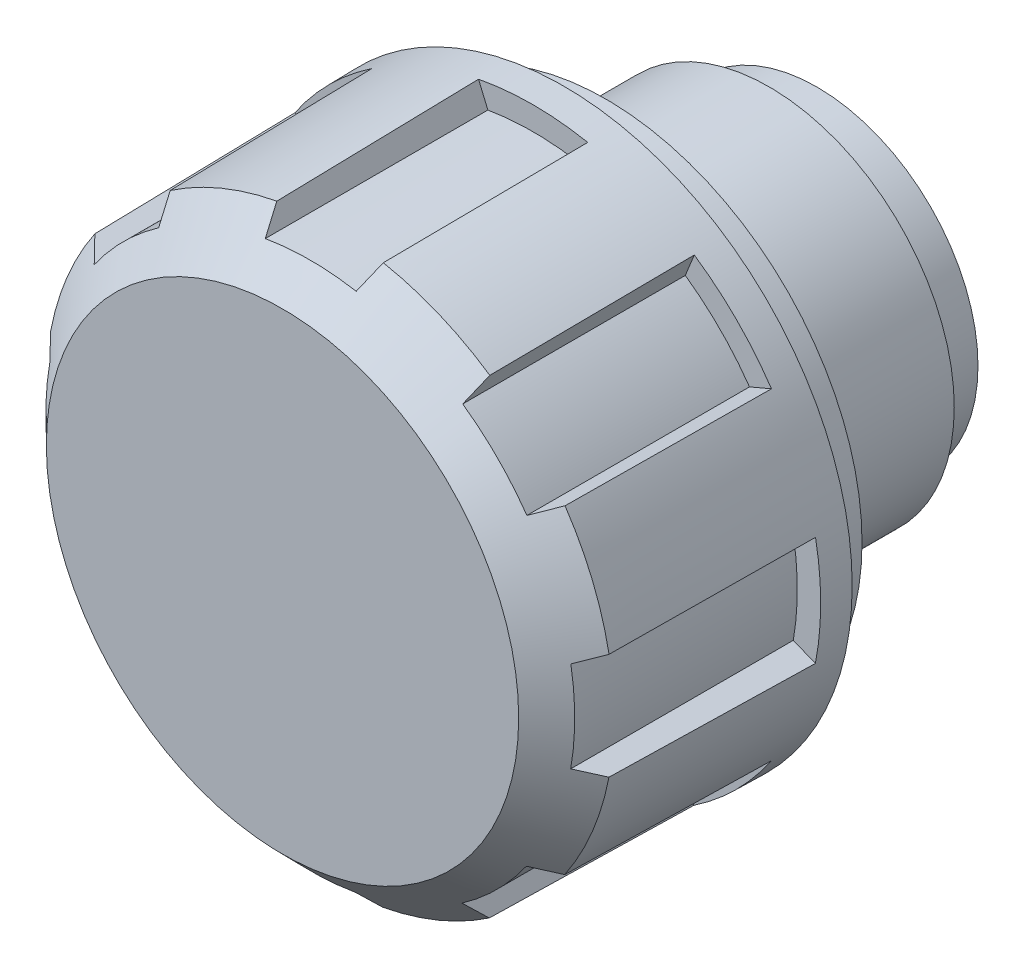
ISO-10303-21;
HEADER;
FILE_DESCRIPTION(('STEP AP214'),'2;1');
FILE_NAME('part.step','',(''),(''),'','','');
FILE_SCHEMA(('AUTOMOTIVE_DESIGN { 1 0 10303 214 1 1 1 1 }'));
ENDSEC;
DATA;
#1=APPLICATION_CONTEXT('core data for automotive mechanical design processes');
#2=APPLICATION_PROTOCOL_DEFINITION('international standard','automotive_design',2000,#1);
#3=PRODUCT_CONTEXT('',#1,'mechanical');
#4=PRODUCT('Part','Part','',(#3));
#5=PRODUCT_RELATED_PRODUCT_CATEGORY('part','',(#4));
#6=PRODUCT_DEFINITION_FORMATION('','',#4);
#7=PRODUCT_DEFINITION_CONTEXT('part definition',#1,'design');
#8=PRODUCT_DEFINITION('design','',#6,#7);
#9=PRODUCT_DEFINITION_SHAPE('','',#8);
#10=(LENGTH_UNIT() NAMED_UNIT(*) SI_UNIT(.MILLI.,.METRE.));
#11=(NAMED_UNIT(*) PLANE_ANGLE_UNIT() SI_UNIT($,.RADIAN.));
#12=(NAMED_UNIT(*) SI_UNIT($,.STERADIAN.) SOLID_ANGLE_UNIT());
#13=UNCERTAINTY_MEASURE_WITH_UNIT(LENGTH_MEASURE(1.E-05),#10,'distance_accuracy_value','');
#14=(GEOMETRIC_REPRESENTATION_CONTEXT(3) GLOBAL_UNCERTAINTY_ASSIGNED_CONTEXT((#13)) GLOBAL_UNIT_ASSIGNED_CONTEXT((#10,
#11,#12)) REPRESENTATION_CONTEXT('',''));
#15=CARTESIAN_POINT('',(0.,0.,0.));
#16=DIRECTION('',(0.,0.,1.));
#17=DIRECTION('',(1.,0.,0.));
#18=AXIS2_PLACEMENT_3D('',#15,#16,#17);
#19=CARTESIAN_POINT('',(0.,0.,1.5));
#20=DIRECTION('',(0.,0.,-1.));
#21=DIRECTION('',(-1.,0.,0.));
#22=AXIS2_PLACEMENT_3D('',#19,#20,#21);
#23=CONICAL_SURFACE('',#22,10.25,0.0174532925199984);
#24=CARTESIAN_POINT('',(0.,0.,2.6));
#25=DIRECTION('',(0.,0.,1.));
#26=DIRECTION('',(1.,0.,0.));
#27=AXIS2_PLACEMENT_3D('',#24,#25,#26);
#28=CIRCLE('',#27,10.2307994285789);
#29=CARTESIAN_POINT('',(1.95072492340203,10.0431035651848,2.6));
#30=VERTEX_POINT('',#29);
#31=CARTESIAN_POINT('',(-1.93268698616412,10.0465903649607,2.6));
#32=VERTEX_POINT('',#31);
#33=EDGE_CURVE('E23',#30,#32,#28,.T.);
#34=ORIENTED_EDGE('',*,*,#33,.F.);
#35=CARTESIAN_POINT('',(1.90261559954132,9.92402881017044,9.8204558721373));
#36=CARTESIAN_POINT('',(1.91063594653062,9.9438798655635,8.6170133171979));
#37=CARTESIAN_POINT('',(1.91865534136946,9.96372856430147,7.41357071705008));
#38=CARTESIAN_POINT('',(1.93469222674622,10.0034212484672,5.00668542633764));
#39=CARTESIAN_POINT('',(1.94270971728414,10.023265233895,3.80324273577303));
#40=CARTESIAN_POINT('',(1.95072625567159,10.0431068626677,2.5998));
#41=B_SPLINE_CURVE_WITH_KNOTS('',3,(#35,#36,#37,#38,#39,#40),.UNSPECIFIED.,.F.,.F.,(4,2,4),(0.,
3.61089896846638,7.22179793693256),.UNSPECIFIED.);
#42=CARTESIAN_POINT('',(1.90261693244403,9.92403210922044,9.8202558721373));
#43=VERTEX_POINT('',#42);
#44=EDGE_CURVE('E978',#43,#30,#41,.T.);
#45=ORIENTED_EDGE('',*,*,#44,.F.);
#46=CARTESIAN_POINT('',(0.,0.,9.8202558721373));
#47=DIRECTION('',(0.,0.,1.));
#48=DIRECTION('',(1.,0.,0.));
#49=AXIS2_PLACEMENT_3D('',#46,#47,#48);
#50=CIRCLE('',#49,10.104769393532);
#51=CARTESIAN_POINT('',(5.68909585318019,8.35108094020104,9.8202558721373));
#52=VERTEX_POINT('',#51);
#53=EDGE_CURVE('E476',#52,#43,#50,.T.);
#54=ORIENTED_EDGE('',*,*,#53,.F.);
#55=CARTESIAN_POINT('',(5.73739743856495,8.47063155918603,2.5998));
#56=CARTESIAN_POINT('',(5.72934927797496,8.45071166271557,3.80324275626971));
#57=CARTESIAN_POINT('',(5.72129995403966,8.43078888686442,5.00668545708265));
#58=CARTESIAN_POINT('',(5.70519897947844,8.39093757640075,7.41357074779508));
#59=CARTESIAN_POINT('',(5.69714732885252,8.37100904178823,8.61701333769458));
#60=CARTESIAN_POINT('',(5.68909451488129,8.35107762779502,9.8204558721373));
#61=B_SPLINE_CURVE_WITH_KNOTS('',3,(#55,#56,#57,#58,#59,#60),.UNSPECIFIED.,.F.,.F.,(4,2,4),(0.,
3.61090354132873,7.22180708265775),.UNSPECIFIED.);
#62=CARTESIAN_POINT('',(5.73739610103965,8.47062824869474,2.6));
#63=VERTEX_POINT('',#62);
#64=EDGE_CURVE('E976',#63,#52,#61,.T.);
#65=ORIENTED_EDGE('',*,*,#64,.F.);
#66=CARTESIAN_POINT('',(8.48091745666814,5.72217581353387,2.6));
#67=VERTEX_POINT('',#66);
#68=EDGE_CURVE('E9',#67,#63,#28,.T.);
#69=ORIENTED_EDGE('',*,*,#68,.F.);
#70=CARTESIAN_POINT('',(8.36270046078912,5.67199567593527,9.8204558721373));
#71=CARTESIAN_POINT('',(8.38240851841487,5.68036125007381,8.6170133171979));
#72=CARTESIAN_POINT('',(8.40211423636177,5.68872583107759,7.41357071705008));
#73=CARTESIAN_POINT('',(8.44152099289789,5.70545300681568,5.00668542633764));
#74=CARTESIAN_POINT('',(8.46122203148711,5.71381560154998,3.80324273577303));
#75=CARTESIAN_POINT('',(8.48092073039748,5.72217720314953,2.5998));
#76=B_SPLINE_CURVE_WITH_KNOTS('',3,(#70,#71,#72,#73,#74,#75),.UNSPECIFIED.,.F.,.F.,(4,2,4),(0.,
3.61089896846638,7.22179793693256),.UNSPECIFIED.);
#77=CARTESIAN_POINT('',(8.3627037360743,5.67199706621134,9.8202558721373));
#78=VERTEX_POINT('',#77);
#79=EDGE_CURVE('E973',#78,#67,#76,.T.);
#80=ORIENTED_EDGE('',*,*,#79,.F.);
#81=CARTESIAN_POINT('',(9.92790421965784,1.88230770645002,9.8202558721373));
#82=VERTEX_POINT('',#81);
#83=EDGE_CURVE('E479',#82,#78,#50,.T.);
#84=ORIENTED_EDGE('',*,*,#83,.F.);
#85=CARTESIAN_POINT('',(10.0465936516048,1.93268838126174,2.5998));
#86=CARTESIAN_POINT('',(10.0268172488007,1.9242937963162,3.80324275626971));
#87=CARTESIAN_POINT('',(10.0070379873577,1.91589799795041,5.00668545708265));
#88=CARTESIAN_POINT('',(9.96747374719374,1.89910397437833,7.41357074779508));
#89=CARTESIAN_POINT('',(9.94768876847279,1.89070574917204,8.61701333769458));
#90=CARTESIAN_POINT('',(9.92790093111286,1.8823063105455,9.8204558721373));
#91=B_SPLINE_CURVE_WITH_KNOTS('',3,(#85,#86,#87,#88,#89,#90),.UNSPECIFIED.,.F.,.F.,(4,2,4),(0.,
3.61090354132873,7.22180708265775),.UNSPECIFIED.);
#92=CARTESIAN_POINT('',(10.0465903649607,1.93268698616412,2.6));
#93=VERTEX_POINT('',#92);
#94=EDGE_CURVE('E971',#93,#82,#91,.T.);
#95=ORIENTED_EDGE('',*,*,#94,.F.);
#96=CARTESIAN_POINT('',(10.0431035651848,-1.95072492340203,2.6));
#97=VERTEX_POINT('',#96);
#98=EDGE_CURVE('E18',#97,#93,#28,.T.);
#99=ORIENTED_EDGE('',*,*,#98,.F.);
#100=CARTESIAN_POINT('',(9.92402881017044,-1.90261559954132,9.8204558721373));
#101=CARTESIAN_POINT('',(9.9438798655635,-1.91063594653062,8.6170133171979));
#102=CARTESIAN_POINT('',(9.96372856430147,-1.91865534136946,7.41357071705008));
#103=CARTESIAN_POINT('',(10.0034212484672,-1.93469222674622,5.00668542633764));
#104=CARTESIAN_POINT('',(10.023265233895,-1.94270971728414,3.80324273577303));
#105=CARTESIAN_POINT('',(10.0431068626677,-1.95072625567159,2.5998));
#106=B_SPLINE_CURVE_WITH_KNOTS('',3,(#100,#101,#102,#103,#104,#105),.UNSPECIFIED.,.F.,.F.,(4,2,
4),(0.,3.61089896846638,7.22179793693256),.UNSPECIFIED.);
#107=CARTESIAN_POINT('',(9.92403210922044,-1.90261693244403,9.8202558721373));
#108=VERTEX_POINT('',#107);
#109=EDGE_CURVE('E980',#108,#97,#106,.T.);
#110=ORIENTED_EDGE('',*,*,#109,.F.);
#111=CARTESIAN_POINT('',(8.35108094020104,-5.68909585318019,9.8202558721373));
#112=VERTEX_POINT('',#111);
#113=EDGE_CURVE('E954',#112,#108,#50,.T.);
#114=ORIENTED_EDGE('',*,*,#113,.F.);
#115=CARTESIAN_POINT('',(8.47063155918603,-5.73739743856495,2.5998));
#116=CARTESIAN_POINT('',(8.45071166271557,-5.72934927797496,3.80324275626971));
#117=CARTESIAN_POINT('',(8.43078888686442,-5.72129995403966,5.00668545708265));
#118=CARTESIAN_POINT('',(8.39093757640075,-5.70519897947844,7.41357074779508));
#119=CARTESIAN_POINT('',(8.37100904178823,-5.69714732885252,8.61701333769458));
#120=CARTESIAN_POINT('',(8.35107762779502,-5.68909451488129,9.8204558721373));
#121=B_SPLINE_CURVE_WITH_KNOTS('',3,(#115,#116,#117,#118,#119,#120),.UNSPECIFIED.,.F.,.F.,(4,2,
4),(0.,3.61090354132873,7.22180708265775),.UNSPECIFIED.);
#122=CARTESIAN_POINT('',(8.47062824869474,-5.73739610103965,2.6));
#123=VERTEX_POINT('',#122);
#124=EDGE_CURVE('E1134',#123,#112,#121,.T.);
#125=ORIENTED_EDGE('',*,*,#124,.F.);
#126=CARTESIAN_POINT('',(5.72217581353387,-8.48091745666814,2.6));
#127=VERTEX_POINT('',#126);
#128=EDGE_CURVE('E1040',#127,#123,#28,.T.);
#129=ORIENTED_EDGE('',*,*,#128,.F.);
#130=CARTESIAN_POINT('',(5.67199567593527,-8.36270046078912,9.8204558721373));
#131=CARTESIAN_POINT('',(5.68036125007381,-8.38240851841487,8.6170133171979));
#132=CARTESIAN_POINT('',(5.68872583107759,-8.40211423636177,7.41357071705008));
#133=CARTESIAN_POINT('',(5.70545300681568,-8.44152099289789,5.00668542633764));
#134=CARTESIAN_POINT('',(5.71381560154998,-8.46122203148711,3.80324273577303));
#135=CARTESIAN_POINT('',(5.72217720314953,-8.48092073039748,2.5998));
#136=B_SPLINE_CURVE_WITH_KNOTS('',3,(#130,#131,#132,#133,#134,#135),.UNSPECIFIED.,.F.,.F.,(4,2,
4),(0.,3.61089896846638,7.22179793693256),.UNSPECIFIED.);
#137=CARTESIAN_POINT('',(5.67199706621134,-8.3627037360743,9.8202558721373));
#138=VERTEX_POINT('',#137);
#139=EDGE_CURVE('E1135',#138,#127,#136,.T.);
#140=ORIENTED_EDGE('',*,*,#139,.F.);
#141=CARTESIAN_POINT('',(1.88230770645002,-9.92790421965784,9.8202558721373));
#142=VERTEX_POINT('',#141);
#143=EDGE_CURVE('E949',#142,#138,#50,.T.);
#144=ORIENTED_EDGE('',*,*,#143,.F.);
#145=CARTESIAN_POINT('',(1.93268838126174,-10.0465936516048,2.5998));
#146=CARTESIAN_POINT('',(1.9242937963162,-10.0268172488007,3.80324275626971));
#147=CARTESIAN_POINT('',(1.91589799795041,-10.0070379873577,5.00668545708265));
#148=CARTESIAN_POINT('',(1.89910397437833,-9.96747374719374,7.41357074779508));
#149=CARTESIAN_POINT('',(1.89070574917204,-9.94768876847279,8.61701333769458));
#150=CARTESIAN_POINT('',(1.8823063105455,-9.92790093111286,9.8204558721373));
#151=B_SPLINE_CURVE_WITH_KNOTS('',3,(#145,#146,#147,#148,#149,#150),.UNSPECIFIED.,.F.,.F.,(4,2,
4),(0.,3.61090354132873,7.22180708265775),.UNSPECIFIED.);
#152=CARTESIAN_POINT('',(1.93268698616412,-10.0465903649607,2.6));
#153=VERTEX_POINT('',#152);
#154=EDGE_CURVE('E1158',#153,#142,#151,.T.);
#155=ORIENTED_EDGE('',*,*,#154,.F.);
#156=CARTESIAN_POINT('',(-1.95072492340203,-10.0431035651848,2.6));
#157=VERTEX_POINT('',#156);
#158=EDGE_CURVE('E1036',#157,#153,#28,.T.);
#159=ORIENTED_EDGE('',*,*,#158,.F.);
#160=CARTESIAN_POINT('',(-1.90261559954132,-9.92402881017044,9.8204558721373));
#161=CARTESIAN_POINT('',(-1.91063594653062,-9.9438798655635,8.6170133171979));
#162=CARTESIAN_POINT('',(-1.91865534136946,-9.96372856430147,7.41357071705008));
#163=CARTESIAN_POINT('',(-1.93469222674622,-10.0034212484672,5.00668542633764));
#164=CARTESIAN_POINT('',(-1.94270971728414,-10.023265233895,3.80324273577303));
#165=CARTESIAN_POINT('',(-1.95072625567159,-10.0431068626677,2.5998));
#166=B_SPLINE_CURVE_WITH_KNOTS('',3,(#160,#161,#162,#163,#164,#165),.UNSPECIFIED.,.F.,.F.,(4,2,
4),(0.,3.61089896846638,7.22179793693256),.UNSPECIFIED.);
#167=CARTESIAN_POINT('',(-1.90261693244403,-9.92403210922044,9.8202558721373));
#168=VERTEX_POINT('',#167);
#169=EDGE_CURVE('E1163',#168,#157,#166,.T.);
#170=ORIENTED_EDGE('',*,*,#169,.F.);
#171=CARTESIAN_POINT('',(-5.68909585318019,-8.35108094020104,9.8202558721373));
#172=VERTEX_POINT('',#171);
#173=EDGE_CURVE('E946',#172,#168,#50,.T.);
#174=ORIENTED_EDGE('',*,*,#173,.F.);
#175=CARTESIAN_POINT('',(-5.73739743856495,-8.47063155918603,2.5998));
#176=CARTESIAN_POINT('',(-5.72934927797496,-8.45071166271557,3.80324275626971));
#177=CARTESIAN_POINT('',(-5.72129995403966,-8.43078888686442,5.00668545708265));
#178=CARTESIAN_POINT('',(-5.70519897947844,-8.39093757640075,7.41357074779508));
#179=CARTESIAN_POINT('',(-5.69714732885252,-8.37100904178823,8.61701333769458));
#180=CARTESIAN_POINT('',(-5.68909451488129,-8.35107762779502,9.8204558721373));
#181=B_SPLINE_CURVE_WITH_KNOTS('',3,(#175,#176,#177,#178,#179,#180),.UNSPECIFIED.,.F.,.F.,(4,2,
4),(0.,3.61090354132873,7.22180708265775),.UNSPECIFIED.);
#182=CARTESIAN_POINT('',(-5.73739610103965,-8.47062824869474,2.6));
#183=VERTEX_POINT('',#182);
#184=EDGE_CURVE('E290',#183,#172,#181,.T.);
#185=ORIENTED_EDGE('',*,*,#184,.F.);
#186=CARTESIAN_POINT('',(-8.48091745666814,-5.72217581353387,2.6));
#187=VERTEX_POINT('',#186);
#188=EDGE_CURVE('E1035',#187,#183,#28,.T.);
#189=ORIENTED_EDGE('',*,*,#188,.F.);
#190=CARTESIAN_POINT('',(-8.36270046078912,-5.67199567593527,9.8204558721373));
#191=CARTESIAN_POINT('',(-8.38240851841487,-5.68036125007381,8.6170133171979));
#192=CARTESIAN_POINT('',(-8.40211423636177,-5.68872583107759,7.41357071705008));
#193=CARTESIAN_POINT('',(-8.44152099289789,-5.70545300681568,5.00668542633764));
#194=CARTESIAN_POINT('',(-8.46122203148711,-5.71381560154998,3.80324273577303));
#195=CARTESIAN_POINT('',(-8.48092073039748,-5.72217720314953,2.5998));
#196=B_SPLINE_CURVE_WITH_KNOTS('',3,(#190,#191,#192,#193,#194,#195),.UNSPECIFIED.,.F.,.F.,(4,2,
4),(0.,3.61089896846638,7.22179793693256),.UNSPECIFIED.);
#197=CARTESIAN_POINT('',(-8.3627037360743,-5.67199706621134,9.8202558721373));
#198=VERTEX_POINT('',#197);
#199=EDGE_CURVE('E281',#198,#187,#196,.T.);
#200=ORIENTED_EDGE('',*,*,#199,.F.);
#201=CARTESIAN_POINT('',(-9.92790421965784,-1.88230770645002,9.8202558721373));
#202=VERTEX_POINT('',#201);
#203=EDGE_CURVE('E942',#202,#198,#50,.T.);
#204=ORIENTED_EDGE('',*,*,#203,.F.);
#205=CARTESIAN_POINT('',(-10.0465936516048,-1.93268838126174,2.5998));
#206=CARTESIAN_POINT('',(-10.0268172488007,-1.9242937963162,3.80324275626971));
#207=CARTESIAN_POINT('',(-10.0070379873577,-1.91589799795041,5.00668545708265));
#208=CARTESIAN_POINT('',(-9.96747374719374,-1.89910397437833,7.41357074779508));
#209=CARTESIAN_POINT('',(-9.94768876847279,-1.89070574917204,8.61701333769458));
#210=CARTESIAN_POINT('',(-9.92790093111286,-1.8823063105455,9.8204558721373));
#211=B_SPLINE_CURVE_WITH_KNOTS('',3,(#205,#206,#207,#208,#209,#210),.UNSPECIFIED.,.F.,.F.,(4,2,
4),(0.,3.61090354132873,7.22180708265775),.UNSPECIFIED.);
#212=CARTESIAN_POINT('',(-10.0465903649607,-1.93268698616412,2.6));
#213=VERTEX_POINT('',#212);
#214=EDGE_CURVE('E461',#213,#202,#211,.T.);
#215=ORIENTED_EDGE('',*,*,#214,.F.);
#216=CARTESIAN_POINT('',(-10.0431035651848,1.95072492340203,2.6));
#217=VERTEX_POINT('',#216);
#218=EDGE_CURVE('E1033',#217,#213,#28,.T.);
#219=ORIENTED_EDGE('',*,*,#218,.F.);
#220=CARTESIAN_POINT('',(-9.92402881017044,1.90261559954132,9.8204558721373));
#221=CARTESIAN_POINT('',(-9.9438798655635,1.91063594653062,8.6170133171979));
#222=CARTESIAN_POINT('',(-9.96372856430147,1.91865534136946,7.41357071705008));
#223=CARTESIAN_POINT('',(-10.0034212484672,1.93469222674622,5.00668542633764));
#224=CARTESIAN_POINT('',(-10.023265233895,1.94270971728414,3.80324273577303));
#225=CARTESIAN_POINT('',(-10.0431068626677,1.95072625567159,2.5998));
#226=B_SPLINE_CURVE_WITH_KNOTS('',3,(#220,#221,#222,#223,#224,#225),.UNSPECIFIED.,.F.,.F.,(4,2,
4),(0.,3.61089896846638,7.22179793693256),.UNSPECIFIED.);
#227=CARTESIAN_POINT('',(-9.92403210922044,1.90261693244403,9.8202558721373));
#228=VERTEX_POINT('',#227);
#229=EDGE_CURVE('E224',#228,#217,#226,.T.);
#230=ORIENTED_EDGE('',*,*,#229,.F.);
#231=CARTESIAN_POINT('',(-8.35108094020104,5.68909585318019,9.8202558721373));
#232=VERTEX_POINT('',#231);
#233=EDGE_CURVE('E945',#232,#228,#50,.T.);
#234=ORIENTED_EDGE('',*,*,#233,.F.);
#235=CARTESIAN_POINT('',(-8.47063155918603,5.73739743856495,2.5998));
#236=CARTESIAN_POINT('',(-8.45071166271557,5.72934927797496,3.80324275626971));
#237=CARTESIAN_POINT('',(-8.43078888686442,5.72129995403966,5.00668545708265));
#238=CARTESIAN_POINT('',(-8.39093757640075,5.70519897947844,7.41357074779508));
#239=CARTESIAN_POINT('',(-8.37100904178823,5.69714732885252,8.61701333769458));
#240=CARTESIAN_POINT('',(-8.35107762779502,5.68909451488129,9.8204558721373));
#241=B_SPLINE_CURVE_WITH_KNOTS('',3,(#235,#236,#237,#238,#239,#240),.UNSPECIFIED.,.F.,.F.,(4,2,
4),(0.,3.61090354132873,7.22180708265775),.UNSPECIFIED.);
#242=CARTESIAN_POINT('',(-8.47062824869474,5.73739610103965,2.6));
#243=VERTEX_POINT('',#242);
#244=EDGE_CURVE('E462',#243,#232,#241,.T.);
#245=ORIENTED_EDGE('',*,*,#244,.F.);
#246=CARTESIAN_POINT('',(-5.72217581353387,8.48091745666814,2.6));
#247=VERTEX_POINT('',#246);
#248=EDGE_CURVE('E1034',#247,#243,#28,.T.);
#249=ORIENTED_EDGE('',*,*,#248,.F.);
#250=CARTESIAN_POINT('',(-5.67199567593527,8.36270046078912,9.8204558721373));
#251=CARTESIAN_POINT('',(-5.68036125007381,8.38240851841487,8.6170133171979));
#252=CARTESIAN_POINT('',(-5.68872583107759,8.40211423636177,7.41357071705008));
#253=CARTESIAN_POINT('',(-5.70545300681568,8.44152099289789,5.00668542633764));
#254=CARTESIAN_POINT('',(-5.71381560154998,8.46122203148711,3.80324273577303));
#255=CARTESIAN_POINT('',(-5.72217720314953,8.48092073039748,2.5998));
#256=B_SPLINE_CURVE_WITH_KNOTS('',3,(#250,#251,#252,#253,#254,#255),.UNSPECIFIED.,.F.,.F.,(4,2,
4),(0.,3.61089896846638,7.22179793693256),.UNSPECIFIED.);
#257=CARTESIAN_POINT('',(-5.67199706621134,8.3627037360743,9.8202558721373));
#258=VERTEX_POINT('',#257);
#259=EDGE_CURVE('E1013',#258,#247,#256,.T.);
#260=ORIENTED_EDGE('',*,*,#259,.F.);
#261=CARTESIAN_POINT('',(-1.88230770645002,9.92790421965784,9.8202558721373));
#262=VERTEX_POINT('',#261);
#263=EDGE_CURVE('E480',#262,#258,#50,.T.);
#264=ORIENTED_EDGE('',*,*,#263,.F.);
#265=CARTESIAN_POINT('',(-1.93268838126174,10.0465936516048,2.5998));
#266=CARTESIAN_POINT('',(-1.9242937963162,10.0268172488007,3.80324275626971));
#267=CARTESIAN_POINT('',(-1.91589799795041,10.0070379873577,5.00668545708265));
#268=CARTESIAN_POINT('',(-1.89910397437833,9.96747374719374,7.41357074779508));
#269=CARTESIAN_POINT('',(-1.89070574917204,9.94768876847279,8.61701333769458));
#270=CARTESIAN_POINT('',(-1.8823063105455,9.92790093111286,9.8204558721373));
#271=B_SPLINE_CURVE_WITH_KNOTS('',3,(#265,#266,#267,#268,#269,#270),.UNSPECIFIED.,.F.,.F.,(4,2,
4),(0.,3.61090354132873,7.22180708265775),.UNSPECIFIED.);
#272=EDGE_CURVE('E1008',#32,#262,#271,.T.);
#273=ORIENTED_EDGE('',*,*,#272,.F.);
#274=EDGE_LOOP('',(#34,#45,#54,#65,#69,#80,#84,#95,#99,#110,#114,#125,#129,#140,#144,#155,#159,
#170,#174,#185,#189,#200,#204,#215,#219,#230,#234,#245,#249,#260,#264,#273));
#275=FACE_BOUND('',#274,.T.);
#276=CARTESIAN_POINT('',(0.,0.,1.5));
#277=DIRECTION('',(0.,0.,1.));
#278=DIRECTION('',(1.,0.,0.));
#279=AXIS2_PLACEMENT_3D('',#276,#277,#278);
#280=CIRCLE('',#279,10.25);
#281=CARTESIAN_POINT('',(10.25,0.,1.5));
#282=VERTEX_POINT('',#281);
#283=EDGE_CURVE('E481',#282,#282,#280,.T.);
#284=ORIENTED_EDGE('',*,*,#283,.T.);
#285=EDGE_LOOP('',(#284));
#286=FACE_BOUND('',#285,.T.);
#287=ADVANCED_FACE('F14',(#275,#286),#23,.T.);
#288=CARTESIAN_POINT('',(0.,0.,9.8202558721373));
#289=DIRECTION('',(0.,0.,-1.));
#290=DIRECTION('',(-1.,0.,0.));
#291=AXIS2_PLACEMENT_3D('',#288,#289,#290);
#292=CONICAL_SURFACE('',#291,10.104769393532,0.794124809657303);
#293=CARTESIAN_POINT('',(0.,0.,11.5));
#294=DIRECTION('',(0.,0.,1.));
#295=DIRECTION('',(1.,0.,0.));
#296=AXIS2_PLACEMENT_3D('',#293,#294,#295);
#297=CIRCLE('',#296,8.3954493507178);
#298=CARTESIAN_POINT('',(8.3954493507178,0.,11.5));
#299=VERTEX_POINT('',#298);
#300=EDGE_CURVE('E473',#299,#299,#297,.T.);
#301=ORIENTED_EDGE('',*,*,#300,.F.);
#302=EDGE_LOOP('',(#301));
#303=FACE_BOUND('',#302,.T.);
#304=CARTESIAN_POINT('',(-9.92809593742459,-1.88238908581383,9.8200558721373));
#305=CARTESIAN_POINT('',(-9.81728266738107,-1.8353516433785,9.93566395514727));
#306=CARTESIAN_POINT('',(-9.70642044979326,-1.78829342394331,10.0512165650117));
#307=CARTESIAN_POINT('',(-9.48459811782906,-1.69413543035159,10.28221084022));
#308=CARTESIAN_POINT('',(-9.37363800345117,-1.64703565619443,10.397652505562));
#309=CARTESIAN_POINT('',(-9.2626289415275,-1.59991510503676,10.5130386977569));
#310=B_SPLINE_CURVE_WITH_KNOTS('',3,(#304,#305,#306,#307,#308,#309),.UNSPECIFIED.,.F.,.F.,(4,2,
4),(0.,0.50071530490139,1.00143061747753),.UNSPECIFIED.);
#311=CARTESIAN_POINT('',(-9.2628289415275,-1.6,10.5128308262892));
#312=VERTEX_POINT('',#311);
#313=EDGE_CURVE('E937',#202,#312,#310,.T.);
#314=ORIENTED_EDGE('',*,*,#313,.F.);
#315=ORIENTED_EDGE('',*,*,#203,.T.);
#316=CARTESIAN_POINT('',(-7.700320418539,-5.39083202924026,10.5130396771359));
#317=CARTESIAN_POINT('',(-7.81082985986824,-5.43774050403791,10.3976330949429));
#318=CARTESIAN_POINT('',(-7.92129910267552,-5.48463191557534,10.2821811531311));
#319=CARTESIAN_POINT('',(-8.14215719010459,-5.57838061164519,10.051186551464));
#320=CARTESIAN_POINT('',(-8.2525460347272,-5.62523789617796,9.93564389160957));
#321=CARTESIAN_POINT('',(-8.36289468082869,-5.67207811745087,9.8200558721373));
#322=B_SPLINE_CURVE_WITH_KNOTS('',3,(#316,#317,#318,#319,#320,#321),.UNSPECIFIED.,.F.,.F.,(4,2,
4),(0.,0.499582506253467,0.999165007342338),.UNSPECIFIED.);
#323=CARTESIAN_POINT('',(-7.700520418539,-5.3909169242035,10.5128308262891));
#324=VERTEX_POINT('',#323);
#325=EDGE_CURVE('E313',#324,#198,#322,.T.);
#326=ORIENTED_EDGE('',*,*,#325,.F.);
#327=CARTESIAN_POINT('',(0.,0.,10.5128308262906));
#328=DIRECTION('',(0.,0.,-1.));
#329=DIRECTION('',(-1.,0.,0.));
#330=AXIS2_PLACEMENT_3D('',#327,#328,#329);
#331=CIRCLE('',#330,9.3999999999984);
#332=CARTESIAN_POINT('',(-5.4184383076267,-7.6811800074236,10.5128308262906));
#333=VERTEX_POINT('',#332);
#334=EDGE_CURVE('E320',#333,#324,#331,.T.);
#335=ORIENTED_EDGE('',*,*,#334,.F.);
#336=CARTESIAN_POINT('',(-5.68917387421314,-8.35127404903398,9.8200558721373));
#337=CARTESIAN_POINT('',(-5.64407765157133,-8.23965698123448,9.93566370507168));
#338=CARTESIAN_POINT('',(-5.59896150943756,-8.12799061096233,10.0512160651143));
#339=CARTESIAN_POINT('',(-5.5086893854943,-7.90455926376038,10.2822098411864));
#340=CARTESIAN_POINT('',(-5.4635334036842,-7.79279428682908,10.3976512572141));
#341=CARTESIAN_POINT('',(-5.41835750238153,-7.6809800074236,10.5130372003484));
#342=B_SPLINE_CURVE_WITH_KNOTS('',3,(#336,#337,#338,#339,#340,#341),.UNSPECIFIED.,.F.,.F.,(4,2,
4),(0.,0.500714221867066,1.00142845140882),.UNSPECIFIED.);
#343=EDGE_CURVE('E334',#172,#333,#342,.T.);
#344=ORIENTED_EDGE('',*,*,#343,.F.);
#345=ORIENTED_EDGE('',*,*,#173,.T.);
#346=CARTESIAN_POINT('',(-1.63305548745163,-9.256844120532,10.5130381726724));
#347=CARTESIAN_POINT('',(-1.67802806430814,-9.36815515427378,10.3976318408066));
#348=CARTESIAN_POINT('',(-1.72298428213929,-9.47942569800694,10.2821801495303));
#349=CARTESIAN_POINT('',(-1.81286399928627,-9.70188580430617,10.051186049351));
#350=CARTESIAN_POINT('',(-1.85778749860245,-9.81307536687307,9.93564364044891));
#351=CARTESIAN_POINT('',(-1.9026946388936,-9.9242244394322,9.8200558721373));
#352=B_SPLINE_CURVE_WITH_KNOTS('',3,(#346,#347,#348,#349,#350,#351),.UNSPECIFIED.,.F.,.F.,(4,2,
4),(0.,0.499581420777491,0.999162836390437),.UNSPECIFIED.);
#353=CARTESIAN_POINT('',(-1.6331362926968,-9.257044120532,10.5128308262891));
#354=VERTEX_POINT('',#353);
#355=EDGE_CURVE('E341',#354,#168,#352,.T.);
#356=ORIENTED_EDGE('',*,*,#355,.F.);
#357=CARTESIAN_POINT('',(0.,0.,10.5128308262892));
#358=DIRECTION('',(0.,0.,-1.));
#359=DIRECTION('',(-1.,0.,0.));
#360=AXIS2_PLACEMENT_3D('',#357,#358,#359);
#361=CIRCLE('',#360,9.39999999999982);
#362=CARTESIAN_POINT('',(1.6,-9.2628289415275,10.5128308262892));
#363=VERTEX_POINT('',#362);
#364=EDGE_CURVE('E1103',#363,#354,#361,.T.);
#365=ORIENTED_EDGE('',*,*,#364,.F.);
#366=CARTESIAN_POINT('',(1.88238908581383,-9.92809593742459,9.8200558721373));
#367=CARTESIAN_POINT('',(1.8353516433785,-9.81728266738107,9.93566395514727));
#368=CARTESIAN_POINT('',(1.78829342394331,-9.70642044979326,10.0512165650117));
#369=CARTESIAN_POINT('',(1.69413543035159,-9.48459811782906,10.28221084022));
#370=CARTESIAN_POINT('',(1.64703565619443,-9.37363800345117,10.397652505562));
#371=CARTESIAN_POINT('',(1.59991510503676,-9.2626289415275,10.5130386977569));
#372=B_SPLINE_CURVE_WITH_KNOTS('',3,(#366,#367,#368,#369,#370,#371),.UNSPECIFIED.,.F.,.F.,(4,2,
4),(0.,0.50071530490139,1.00143061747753),.UNSPECIFIED.);
#373=EDGE_CURVE('E350',#142,#363,#372,.T.);
#374=ORIENTED_EDGE('',*,*,#373,.F.);
#375=ORIENTED_EDGE('',*,*,#143,.T.);
#376=CARTESIAN_POINT('',(5.39083202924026,-7.700320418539,10.5130396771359));
#377=CARTESIAN_POINT('',(5.43774050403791,-7.81082985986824,10.3976330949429));
#378=CARTESIAN_POINT('',(5.48463191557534,-7.92129910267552,10.2821811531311));
#379=CARTESIAN_POINT('',(5.57838061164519,-8.14215719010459,10.051186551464));
#380=CARTESIAN_POINT('',(5.62523789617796,-8.2525460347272,9.93564389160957));
#381=CARTESIAN_POINT('',(5.67207811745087,-8.36289468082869,9.8200558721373));
#382=B_SPLINE_CURVE_WITH_KNOTS('',3,(#376,#377,#378,#379,#380,#381),.UNSPECIFIED.,.F.,.F.,(4,2,
4),(0.,0.499582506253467,0.999165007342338),.UNSPECIFIED.);
#383=CARTESIAN_POINT('',(5.3909169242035,-7.700520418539,10.5128308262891));
#384=VERTEX_POINT('',#383);
#385=EDGE_CURVE('E358',#384,#138,#382,.T.);
#386=ORIENTED_EDGE('',*,*,#385,.F.);
#387=CARTESIAN_POINT('',(0.,0.,10.5128308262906));
#388=DIRECTION('',(0.,0.,-1.));
#389=DIRECTION('',(-1.,0.,0.));
#390=AXIS2_PLACEMENT_3D('',#387,#388,#389);
#391=CIRCLE('',#390,9.3999999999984);
#392=CARTESIAN_POINT('',(7.6811800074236,-5.4184383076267,10.5128308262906));
#393=VERTEX_POINT('',#392);
#394=EDGE_CURVE('E1098',#393,#384,#391,.T.);
#395=ORIENTED_EDGE('',*,*,#394,.F.);
#396=CARTESIAN_POINT('',(8.35127404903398,-5.68917387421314,9.8200558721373));
#397=CARTESIAN_POINT('',(8.23965698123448,-5.64407765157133,9.93566370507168));
#398=CARTESIAN_POINT('',(8.12799061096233,-5.59896150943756,10.0512160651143));
#399=CARTESIAN_POINT('',(7.90455926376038,-5.5086893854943,10.2822098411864));
#400=CARTESIAN_POINT('',(7.79279428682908,-5.4635334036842,10.3976512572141));
#401=CARTESIAN_POINT('',(7.6809800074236,-5.41835750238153,10.5130372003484));
#402=B_SPLINE_CURVE_WITH_KNOTS('',3,(#396,#397,#398,#399,#400,#401),.UNSPECIFIED.,.F.,.F.,(4,2,
4),(0.,0.500714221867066,1.00142845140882),.UNSPECIFIED.);
#403=EDGE_CURVE('E367',#112,#393,#402,.T.);
#404=ORIENTED_EDGE('',*,*,#403,.F.);
#405=ORIENTED_EDGE('',*,*,#113,.T.);
#406=CARTESIAN_POINT('',(9.256844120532,-1.63305548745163,10.5130381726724));
#407=CARTESIAN_POINT('',(9.36815515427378,-1.67802806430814,10.3976318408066));
#408=CARTESIAN_POINT('',(9.47942569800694,-1.72298428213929,10.2821801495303));
#409=CARTESIAN_POINT('',(9.70188580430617,-1.81286399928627,10.051186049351));
#410=CARTESIAN_POINT('',(9.81307536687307,-1.85778749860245,9.93564364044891));
#411=CARTESIAN_POINT('',(9.9242244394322,-1.9026946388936,9.8200558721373));
#412=B_SPLINE_CURVE_WITH_KNOTS('',3,(#406,#407,#408,#409,#410,#411),.UNSPECIFIED.,.F.,.F.,(4,2,
4),(0.,0.499581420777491,0.999162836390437),.UNSPECIFIED.);
#413=CARTESIAN_POINT('',(9.257044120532,-1.6331362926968,10.5128308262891));
#414=VERTEX_POINT('',#413);
#415=EDGE_CURVE('E375',#414,#108,#412,.T.);
#416=ORIENTED_EDGE('',*,*,#415,.F.);
#417=CARTESIAN_POINT('',(0.,0.,10.5128308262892));
#418=DIRECTION('',(0.,0.,-1.));
#419=DIRECTION('',(-1.,0.,0.));
#420=AXIS2_PLACEMENT_3D('',#417,#418,#419);
#421=CIRCLE('',#420,9.39999999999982);
#422=CARTESIAN_POINT('',(9.2628289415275,1.6,10.5128308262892));
#423=VERTEX_POINT('',#422);
#424=EDGE_CURVE('E1095',#423,#414,#421,.T.);
#425=ORIENTED_EDGE('',*,*,#424,.F.);
#426=CARTESIAN_POINT('',(9.92809593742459,1.88238908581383,9.8200558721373));
#427=CARTESIAN_POINT('',(9.81728266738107,1.8353516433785,9.93566395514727));
#428=CARTESIAN_POINT('',(9.70642044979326,1.78829342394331,10.0512165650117));
#429=CARTESIAN_POINT('',(9.48459811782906,1.69413543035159,10.28221084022));
#430=CARTESIAN_POINT('',(9.37363800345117,1.64703565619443,10.397652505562));
#431=CARTESIAN_POINT('',(9.2626289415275,1.59991510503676,10.5130386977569));
#432=B_SPLINE_CURVE_WITH_KNOTS('',3,(#426,#427,#428,#429,#430,#431),.UNSPECIFIED.,.F.,.F.,(4,2,
4),(0.,0.50071530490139,1.00143061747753),.UNSPECIFIED.);
#433=EDGE_CURVE('E384',#82,#423,#432,.T.);
#434=ORIENTED_EDGE('',*,*,#433,.F.);
#435=ORIENTED_EDGE('',*,*,#83,.T.);
#436=CARTESIAN_POINT('',(7.700320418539,5.39083202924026,10.5130396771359));
#437=CARTESIAN_POINT('',(7.81082985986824,5.43774050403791,10.3976330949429));
#438=CARTESIAN_POINT('',(7.92129910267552,5.48463191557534,10.2821811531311));
#439=CARTESIAN_POINT('',(8.14215719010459,5.57838061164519,10.051186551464));
#440=CARTESIAN_POINT('',(8.2525460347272,5.62523789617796,9.93564389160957));
#441=CARTESIAN_POINT('',(8.36289468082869,5.67207811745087,9.8200558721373));
#442=B_SPLINE_CURVE_WITH_KNOTS('',3,(#436,#437,#438,#439,#440,#441),.UNSPECIFIED.,.F.,.F.,(4,2,
4),(0.,0.499582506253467,0.999165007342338),.UNSPECIFIED.);
#443=CARTESIAN_POINT('',(7.700520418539,5.3909169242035,10.5128308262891));
#444=VERTEX_POINT('',#443);
#445=EDGE_CURVE('E392',#444,#78,#442,.T.);
#446=ORIENTED_EDGE('',*,*,#445,.F.);
#447=CARTESIAN_POINT('',(0.,0.,10.5128308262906));
#448=DIRECTION('',(0.,0.,-1.));
#449=DIRECTION('',(-1.,0.,0.));
#450=AXIS2_PLACEMENT_3D('',#447,#448,#449);
#451=CIRCLE('',#450,9.3999999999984);
#452=CARTESIAN_POINT('',(5.4184383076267,7.6811800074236,10.5128308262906));
#453=VERTEX_POINT('',#452);
#454=EDGE_CURVE('E1091',#453,#444,#451,.T.);
#455=ORIENTED_EDGE('',*,*,#454,.F.);
#456=CARTESIAN_POINT('',(5.68917387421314,8.35127404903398,9.8200558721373));
#457=CARTESIAN_POINT('',(5.64407765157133,8.23965698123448,9.93566370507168));
#458=CARTESIAN_POINT('',(5.59896150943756,8.12799061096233,10.0512160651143));
#459=CARTESIAN_POINT('',(5.5086893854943,7.90455926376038,10.2822098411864));
#460=CARTESIAN_POINT('',(5.4635334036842,7.79279428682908,10.3976512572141));
#461=CARTESIAN_POINT('',(5.41835750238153,7.6809800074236,10.5130372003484));
#462=B_SPLINE_CURVE_WITH_KNOTS('',3,(#456,#457,#458,#459,#460,#461),.UNSPECIFIED.,.F.,.F.,(4,2,
4),(0.,0.500714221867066,1.00142845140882),.UNSPECIFIED.);
#463=EDGE_CURVE('E401',#52,#453,#462,.T.);
#464=ORIENTED_EDGE('',*,*,#463,.F.);
#465=ORIENTED_EDGE('',*,*,#53,.T.);
#466=CARTESIAN_POINT('',(1.63305548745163,9.256844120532,10.5130381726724));
#467=CARTESIAN_POINT('',(1.67802806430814,9.36815515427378,10.3976318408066));
#468=CARTESIAN_POINT('',(1.72298428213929,9.47942569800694,10.2821801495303));
#469=CARTESIAN_POINT('',(1.81286399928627,9.70188580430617,10.051186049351));
#470=CARTESIAN_POINT('',(1.85778749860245,9.81307536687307,9.93564364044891));
#471=CARTESIAN_POINT('',(1.9026946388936,9.9242244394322,9.8200558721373));
#472=B_SPLINE_CURVE_WITH_KNOTS('',3,(#466,#467,#468,#469,#470,#471),.UNSPECIFIED.,.F.,.F.,(4,2,
4),(0.,0.499581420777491,0.999162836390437),.UNSPECIFIED.);
#473=CARTESIAN_POINT('',(1.6331362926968,9.257044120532,10.5128308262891));
#474=VERTEX_POINT('',#473);
#475=EDGE_CURVE('E409',#474,#43,#472,.T.);
#476=ORIENTED_EDGE('',*,*,#475,.F.);
#477=CARTESIAN_POINT('',(0.,0.,10.5128308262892));
#478=DIRECTION('',(0.,0.,-1.));
#479=DIRECTION('',(-1.,0.,0.));
#480=AXIS2_PLACEMENT_3D('',#477,#478,#479);
#481=CIRCLE('',#480,9.39999999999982);
#482=CARTESIAN_POINT('',(-1.6,9.2628289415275,10.5128308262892));
#483=VERTEX_POINT('',#482);
#484=EDGE_CURVE('E1089',#483,#474,#481,.T.);
#485=ORIENTED_EDGE('',*,*,#484,.F.);
#486=CARTESIAN_POINT('',(-1.88238908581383,9.92809593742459,9.8200558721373));
#487=CARTESIAN_POINT('',(-1.8353516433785,9.81728266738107,9.93566395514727));
#488=CARTESIAN_POINT('',(-1.78829342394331,9.70642044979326,10.0512165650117));
#489=CARTESIAN_POINT('',(-1.69413543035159,9.48459811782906,10.28221084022));
#490=CARTESIAN_POINT('',(-1.64703565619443,9.37363800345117,10.397652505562));
#491=CARTESIAN_POINT('',(-1.59991510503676,9.2626289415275,10.5130386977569));
#492=B_SPLINE_CURVE_WITH_KNOTS('',3,(#486,#487,#488,#489,#490,#491),.UNSPECIFIED.,.F.,.F.,(4,2,
4),(0.,0.50071530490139,1.00143061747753),.UNSPECIFIED.);
#493=EDGE_CURVE('E418',#262,#483,#492,.T.);
#494=ORIENTED_EDGE('',*,*,#493,.F.);
#495=ORIENTED_EDGE('',*,*,#263,.T.);
#496=CARTESIAN_POINT('',(-5.39083202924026,7.700320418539,10.5130396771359));
#497=CARTESIAN_POINT('',(-5.43774050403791,7.81082985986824,10.3976330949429));
#498=CARTESIAN_POINT('',(-5.48463191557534,7.92129910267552,10.2821811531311));
#499=CARTESIAN_POINT('',(-5.57838061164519,8.14215719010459,10.051186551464));
#500=CARTESIAN_POINT('',(-5.62523789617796,8.2525460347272,9.93564389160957));
#501=CARTESIAN_POINT('',(-5.67207811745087,8.36289468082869,9.8200558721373));
#502=B_SPLINE_CURVE_WITH_KNOTS('',3,(#496,#497,#498,#499,#500,#501),.UNSPECIFIED.,.F.,.F.,(4,2,
4),(0.,0.499582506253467,0.999165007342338),.UNSPECIFIED.);
#503=CARTESIAN_POINT('',(-5.3909169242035,7.700520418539,10.5128308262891));
#504=VERTEX_POINT('',#503);
#505=EDGE_CURVE('E426',#504,#258,#502,.T.);
#506=ORIENTED_EDGE('',*,*,#505,.F.);
#507=CARTESIAN_POINT('',(0.,0.,10.5128308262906));
#508=DIRECTION('',(0.,0.,-1.));
#509=DIRECTION('',(-1.,0.,0.));
#510=AXIS2_PLACEMENT_3D('',#507,#508,#509);
#511=CIRCLE('',#510,9.3999999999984);
#512=CARTESIAN_POINT('',(-7.6811800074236,5.4184383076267,10.5128308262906));
#513=VERTEX_POINT('',#512);
#514=EDGE_CURVE('E1032',#513,#504,#511,.T.);
#515=ORIENTED_EDGE('',*,*,#514,.F.);
#516=CARTESIAN_POINT('',(-8.35127404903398,5.68917387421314,9.8200558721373));
#517=CARTESIAN_POINT('',(-8.23965698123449,5.64407765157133,9.93566370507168));
#518=CARTESIAN_POINT('',(-8.12799061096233,5.59896150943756,10.0512160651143));
#519=CARTESIAN_POINT('',(-7.90455926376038,5.5086893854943,10.2822098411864));
#520=CARTESIAN_POINT('',(-7.79279428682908,5.4635334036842,10.3976512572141));
#521=CARTESIAN_POINT('',(-7.6809800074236,5.41835750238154,10.5130372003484));
#522=B_SPLINE_CURVE_WITH_KNOTS('',3,(#516,#517,#518,#519,#520,#521),.UNSPECIFIED.,.F.,.F.,(4,2,
4),(0.,0.500714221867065,1.00142845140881),.UNSPECIFIED.);
#523=EDGE_CURVE('E434',#232,#513,#522,.T.);
#524=ORIENTED_EDGE('',*,*,#523,.F.);
#525=ORIENTED_EDGE('',*,*,#233,.T.);
#526=CARTESIAN_POINT('',(-9.256844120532,1.63305548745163,10.5130381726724));
#527=CARTESIAN_POINT('',(-9.36815515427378,1.67802806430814,10.3976318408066));
#528=CARTESIAN_POINT('',(-9.47942569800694,1.72298428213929,10.2821801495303));
#529=CARTESIAN_POINT('',(-9.70188580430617,1.81286399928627,10.051186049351));
#530=CARTESIAN_POINT('',(-9.81307536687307,1.85778749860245,9.93564364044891));
#531=CARTESIAN_POINT('',(-9.9242244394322,1.9026946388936,9.8200558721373));
#532=B_SPLINE_CURVE_WITH_KNOTS('',3,(#526,#527,#528,#529,#530,#531),.UNSPECIFIED.,.F.,.F.,(4,2,
4),(0.,0.499581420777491,0.999162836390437),.UNSPECIFIED.);
#533=CARTESIAN_POINT('',(-9.257044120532,1.6331362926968,10.5128308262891));
#534=VERTEX_POINT('',#533);
#535=EDGE_CURVE('E441',#534,#228,#532,.T.);
#536=ORIENTED_EDGE('',*,*,#535,.F.);
#537=CARTESIAN_POINT('',(0.,0.,10.5128308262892));
#538=DIRECTION('',(0.,0.,-1.));
#539=DIRECTION('',(-1.,0.,0.));
#540=AXIS2_PLACEMENT_3D('',#537,#538,#539);
#541=CIRCLE('',#540,9.39999999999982);
#542=EDGE_CURVE('E237',#312,#534,#541,.T.);
#543=ORIENTED_EDGE('',*,*,#542,.F.);
#544=EDGE_LOOP('',(#314,#315,#326,#335,#344,#345,#356,#365,#374,#375,#386,#395,#404,#405,#416,
#425,#434,#435,#446,#455,#464,#465,#476,#485,#494,#495,#506,#515,#524,#525,#536,#543));
#545=FACE_BOUND('',#544,.T.);
#546=ADVANCED_FACE('F324',(#303,#545),#292,.T.);
#547=CARTESIAN_POINT('',(0.,0.,7.5));
#548=DIRECTION('',(0.,0.,1.));
#549=DIRECTION('',(1.,0.,0.));
#550=AXIS2_PLACEMENT_3D('',#547,#548,#549);
#551=PLANE('',#550);
#552=CARTESIAN_POINT('',(0.,0.,7.5));
#553=DIRECTION('',(0.,0.,1.));
#554=DIRECTION('',(1.,0.,0.));
#555=AXIS2_PLACEMENT_3D('',#552,#553,#554);
#556=CIRCLE('',#555,3.2104996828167);
#557=CARTESIAN_POINT('',(3.2104996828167,0.,7.5));
#558=VERTEX_POINT('',#557);
#559=EDGE_CURVE('E321',#558,#558,#556,.T.);
#560=ORIENTED_EDGE('',*,*,#559,.F.);
#561=EDGE_LOOP('',(#560));
#562=FACE_BOUND('',#561,.T.);
#563=ADVANCED_FACE('F16',(#562),#551,.F.);
#564=CARTESIAN_POINT('',(0.,0.,6.50000000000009));
#565=DIRECTION('',(0.,0.,1.));
#566=DIRECTION('',(1.,0.,0.));
#567=AXIS2_PLACEMENT_3D('',#564,#565,#566);
#568=TOROIDAL_SURFACE('',#567,3.21049968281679,0.999999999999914);
#569=CARTESIAN_POINT('',(0.,0.,6.5348994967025));
#570=DIRECTION('',(0.,0.,1.));
#571=DIRECTION('',(1.,0.,0.));
#572=AXIS2_PLACEMENT_3D('',#569,#570,#571);
#573=CIRCLE('',#572,4.2098905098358);
#574=CARTESIAN_POINT('',(4.2098905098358,0.,6.5348994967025));
#575=VERTEX_POINT('',#574);
#576=EDGE_CURVE('E504',#575,#575,#573,.T.);
#577=ORIENTED_EDGE('',*,*,#576,.F.);
#578=EDGE_LOOP('',(#577));
#579=FACE_BOUND('',#578,.T.);
#580=ORIENTED_EDGE('',*,*,#559,.T.);
#581=EDGE_LOOP('',(#580));
#582=FACE_BOUND('',#581,.T.);
#583=ADVANCED_FACE('F511',(#579,#582),#568,.F.);
#584=CARTESIAN_POINT('',(0.,0.,6.5348994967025));
#585=DIRECTION('',(0.,0.,-1.));
#586=DIRECTION('',(-1.,0.,0.));
#587=AXIS2_PLACEMENT_3D('',#584,#585,#586);
#588=CONICAL_SURFACE('',#587,4.2098905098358,0.034906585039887);
#589=CARTESIAN_POINT('',(0.,0.,-7.5));
#590=DIRECTION('',(0.,0.,1.));
#591=DIRECTION('',(1.,0.,0.));
#592=AXIS2_PLACEMENT_3D('',#589,#590,#591);
#593=CIRCLE('',#592,4.7);
#594=CARTESIAN_POINT('',(4.7,0.,-7.5));
#595=VERTEX_POINT('',#594);
#596=EDGE_CURVE('E502',#595,#595,#593,.T.);
#597=ORIENTED_EDGE('',*,*,#596,.F.);
#598=EDGE_LOOP('',(#597));
#599=FACE_BOUND('',#598,.T.);
#600=ORIENTED_EDGE('',*,*,#576,.T.);
#601=EDGE_LOOP('',(#600));
#602=FACE_BOUND('',#601,.T.);
#603=ADVANCED_FACE('F519',(#599,#602),#588,.F.);
#604=CARTESIAN_POINT('',(0.,4.7,-7.5));
#605=DIRECTION('',(0.,0.,1.));
#606=DIRECTION('',(1.,0.,0.));
#607=AXIS2_PLACEMENT_3D('',#604,#605,#606);
#608=PLANE('',#607);
#609=CARTESIAN_POINT('',(0.,0.,-7.5));
#610=DIRECTION('',(0.,0.,1.));
#611=DIRECTION('',(1.,0.,0.));
#612=AXIS2_PLACEMENT_3D('',#609,#610,#611);
#613=CIRCLE('',#612,5.7225);
#614=CARTESIAN_POINT('',(5.7225,0.,-7.5));
#615=VERTEX_POINT('',#614);
#616=EDGE_CURVE('E499',#615,#615,#613,.T.);
#617=ORIENTED_EDGE('',*,*,#616,.F.);
#618=EDGE_LOOP('',(#617));
#619=FACE_BOUND('',#618,.T.);
#620=ORIENTED_EDGE('',*,*,#596,.T.);
#621=EDGE_LOOP('',(#620));
#622=FACE_BOUND('',#621,.T.);
#623=ADVANCED_FACE('F564',(#619,#622),#608,.F.);
#624=CARTESIAN_POINT('',(0.,0.,11.5));
#625=DIRECTION('',(0.,0.,1.));
#626=DIRECTION('',(1.,0.,0.));
#627=AXIS2_PLACEMENT_3D('',#624,#625,#626);
#628=CYLINDRICAL_SURFACE('',#627,5.7225);
#629=CARTESIAN_POINT('',(0.,0.,-5.8));
#630=DIRECTION('',(0.,0.,1.));
#631=DIRECTION('',(1.,0.,0.));
#632=AXIS2_PLACEMENT_3D('',#629,#630,#631);
#633=CIRCLE('',#632,5.7225);
#634=CARTESIAN_POINT('',(5.7225,0.,-5.8));
#635=VERTEX_POINT('',#634);
#636=EDGE_CURVE('E496',#635,#635,#633,.T.);
#637=ORIENTED_EDGE('',*,*,#636,.F.);
#638=EDGE_LOOP('',(#637));
#639=FACE_BOUND('',#638,.T.);
#640=ORIENTED_EDGE('',*,*,#616,.T.);
#641=EDGE_LOOP('',(#640));
#642=FACE_BOUND('',#641,.T.);
#643=ADVANCED_FACE('F558',(#639,#642),#628,.T.);
#644=CARTESIAN_POINT('',(0.,5.7225,-5.8));
#645=DIRECTION('',(0.,0.,1.));
#646=DIRECTION('',(1.,0.,0.));
#647=AXIS2_PLACEMENT_3D('',#644,#645,#646);
#648=PLANE('',#647);
#649=CARTESIAN_POINT('',(0.,0.,-5.8));
#650=DIRECTION('',(0.,0.,1.));
#651=DIRECTION('',(1.,0.,0.));
#652=AXIS2_PLACEMENT_3D('',#649,#650,#651);
#653=CIRCLE('',#652,6.5785);
#654=CARTESIAN_POINT('',(6.5785,0.,-5.8));
#655=VERTEX_POINT('',#654);
#656=EDGE_CURVE('E493',#655,#655,#653,.T.);
#657=ORIENTED_EDGE('',*,*,#656,.F.);
#658=EDGE_LOOP('',(#657));
#659=FACE_BOUND('',#658,.T.);
#660=ORIENTED_EDGE('',*,*,#636,.T.);
#661=EDGE_LOOP('',(#660));
#662=FACE_BOUND('',#661,.T.);
#663=ADVANCED_FACE('F552',(#659,#662),#648,.F.);
#664=CARTESIAN_POINT('',(0.,0.,11.5));
#665=DIRECTION('',(0.,0.,1.));
#666=DIRECTION('',(1.,0.,0.));
#667=AXIS2_PLACEMENT_3D('',#664,#665,#666);
#668=CYLINDRICAL_SURFACE('',#667,6.5785);
#669=CARTESIAN_POINT('',(0.,0.,0.));
#670=DIRECTION('',(0.,0.,1.));
#671=DIRECTION('',(1.,0.,0.));
#672=AXIS2_PLACEMENT_3D('',#669,#670,#671);
#673=CIRCLE('',#672,6.5785);
#674=CARTESIAN_POINT('',(6.5785,0.,0.));
#675=VERTEX_POINT('',#674);
#676=EDGE_CURVE('E490',#675,#675,#673,.T.);
#677=ORIENTED_EDGE('',*,*,#676,.F.);
#678=EDGE_LOOP('',(#677));
#679=FACE_BOUND('',#678,.T.);
#680=ORIENTED_EDGE('',*,*,#656,.T.);
#681=EDGE_LOOP('',(#680));
#682=FACE_BOUND('',#681,.T.);
#683=ADVANCED_FACE('F546',(#679,#682),#668,.T.);
#684=CARTESIAN_POINT('',(0.,6.5785,0.));
#685=DIRECTION('',(0.,0.,1.));
#686=DIRECTION('',(1.,0.,0.));
#687=AXIS2_PLACEMENT_3D('',#684,#685,#686);
#688=PLANE('',#687);
#689=CARTESIAN_POINT('',(0.,0.,0.));
#690=DIRECTION('',(0.,0.,1.));
#691=DIRECTION('',(1.,0.,0.));
#692=AXIS2_PLACEMENT_3D('',#689,#690,#691);
#693=CIRCLE('',#692,9.1);
#694=CARTESIAN_POINT('',(9.1,0.,0.));
#695=VERTEX_POINT('',#694);
#696=EDGE_CURVE('E487',#695,#695,#693,.T.);
#697=ORIENTED_EDGE('',*,*,#696,.F.);
#698=EDGE_LOOP('',(#697));
#699=FACE_BOUND('',#698,.T.);
#700=ORIENTED_EDGE('',*,*,#676,.T.);
#701=EDGE_LOOP('',(#700));
#702=FACE_BOUND('',#701,.T.);
#703=ADVANCED_FACE('F540',(#699,#702),#688,.F.);
#704=CARTESIAN_POINT('',(0.,0.,11.5));
#705=DIRECTION('',(0.,0.,1.));
#706=DIRECTION('',(1.,0.,0.));
#707=AXIS2_PLACEMENT_3D('',#704,#705,#706);
#708=CYLINDRICAL_SURFACE('',#707,9.1);
#709=CARTESIAN_POINT('',(0.,0.,1.5));
#710=DIRECTION('',(0.,0.,1.));
#711=DIRECTION('',(1.,0.,0.));
#712=AXIS2_PLACEMENT_3D('',#709,#710,#711);
#713=CIRCLE('',#712,9.1);
#714=CARTESIAN_POINT('',(9.1,0.,1.5));
#715=VERTEX_POINT('',#714);
#716=EDGE_CURVE('E484',#715,#715,#713,.T.);
#717=ORIENTED_EDGE('',*,*,#716,.F.);
#718=EDGE_LOOP('',(#717));
#719=FACE_BOUND('',#718,.T.);
#720=ORIENTED_EDGE('',*,*,#696,.T.);
#721=EDGE_LOOP('',(#720));
#722=FACE_BOUND('',#721,.T.);
#723=ADVANCED_FACE('F535',(#719,#722),#708,.T.);
#724=CARTESIAN_POINT('',(0.,9.1,1.5));
#725=DIRECTION('',(0.,0.,1.));
#726=DIRECTION('',(1.,0.,0.));
#727=AXIS2_PLACEMENT_3D('',#724,#725,#726);
#728=PLANE('',#727);
#729=ORIENTED_EDGE('',*,*,#283,.F.);
#730=EDGE_LOOP('',(#729));
#731=FACE_BOUND('',#730,.T.);
#732=ORIENTED_EDGE('',*,*,#716,.T.);
#733=EDGE_LOOP('',(#732));
#734=FACE_BOUND('',#733,.T.);
#735=ADVANCED_FACE('F532',(#731,#734),#728,.F.);
#736=CARTESIAN_POINT('',(0.,8.3954493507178,11.5));
#737=DIRECTION('',(0.,0.,-1.));
#738=DIRECTION('',(-1.,0.,0.));
#739=AXIS2_PLACEMENT_3D('',#736,#737,#738);
#740=PLANE('',#739);
#741=ORIENTED_EDGE('',*,*,#300,.T.);
#742=EDGE_LOOP('',(#741));
#743=FACE_BOUND('',#742,.T.);
#744=ADVANCED_FACE('F306',(#743),#740,.F.);
#745=CARTESIAN_POINT('',(-8.7332404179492,-5.8292805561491,2.6));
#746=DIRECTION('',(0.390731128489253,-0.920504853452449,0.));
#747=DIRECTION('',(0.920504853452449,0.390731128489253,0.));
#748=AXIS2_PLACEMENT_3D('',#745,#746,#747);
#749=PLANE('',#748);
#750=ORIENTED_EDGE('',*,*,#199,.T.);
#751=DIRECTION('',(0.920504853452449,0.390731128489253,0.));
#752=VECTOR('',#751,1.);
#753=CARTESIAN_POINT('',(-8.7332404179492,-5.8292805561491,2.6));
#754=LINE('',#753,#752);
#755=CARTESIAN_POINT('',(-7.700520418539,-5.3909169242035,2.6));
#756=VERTEX_POINT('',#755);
#757=EDGE_CURVE('E1113',#187,#756,#754,.T.);
#758=ORIENTED_EDGE('',*,*,#757,.T.);
#759=DIRECTION('',(0.,0.,1.));
#760=VECTOR('',#759,1.);
#761=CARTESIAN_POINT('',(-7.700520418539,-5.3909169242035,2.6));
#762=LINE('',#761,#760);
#763=EDGE_CURVE('E248',#756,#324,#762,.T.);
#764=ORIENTED_EDGE('',*,*,#763,.T.);
#765=ORIENTED_EDGE('',*,*,#325,.T.);
#766=EDGE_LOOP('',(#750,#758,#764,#765));
#767=FACE_BOUND('',#766,.T.);
#768=ADVANCED_FACE('F300',(#767),#749,.T.);
#769=CARTESIAN_POINT('',(-1.07552855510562E-12,-1.22991894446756E-12,2.6));
#770=DIRECTION('',(0.,0.,1.));
#771=DIRECTION('',(1.,0.,0.));
#772=AXIS2_PLACEMENT_3D('',#769,#770,#771);
#773=CYLINDRICAL_SURFACE('',#772,9.3999999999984);
#774=ORIENTED_EDGE('',*,*,#334,.T.);
#775=ORIENTED_EDGE('',*,*,#763,.F.);
#776=CARTESIAN_POINT('',(-1.07552855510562E-12,-1.22991894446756E-12,2.6));
#777=DIRECTION('',(0.,0.,1.));
#778=DIRECTION('',(1.,0.,0.));
#779=AXIS2_PLACEMENT_3D('',#776,#777,#778);
#780=CIRCLE('',#779,9.3999999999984);
#781=CARTESIAN_POINT('',(-5.4184383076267,-7.6811800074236,2.6));
#782=VERTEX_POINT('',#781);
#783=EDGE_CURVE('E1114',#756,#782,#780,.T.);
#784=ORIENTED_EDGE('',*,*,#783,.T.);
#785=DIRECTION('',(0.,0.,1.));
#786=VECTOR('',#785,1.);
#787=CARTESIAN_POINT('',(-5.4184383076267,-7.6811800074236,2.6));
#788=LINE('',#787,#786);
#789=EDGE_CURVE('E250',#782,#333,#788,.T.);
#790=ORIENTED_EDGE('',*,*,#789,.T.);
#791=EDGE_LOOP('',(#774,#775,#784,#790));
#792=FACE_BOUND('',#791,.T.);
#793=ADVANCED_FACE('F305',(#792),#773,.T.);
#794=CARTESIAN_POINT('',(-5.4184383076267,-7.6811800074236,2.6));
#795=DIRECTION('',(-0.927183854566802,0.374606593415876,0.));
#796=DIRECTION('',(-0.374606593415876,-0.927183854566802,0.));
#797=AXIS2_PLACEMENT_3D('',#794,#795,#796);
#798=PLANE('',#797);
#799=ORIENTED_EDGE('',*,*,#184,.T.);
#800=ORIENTED_EDGE('',*,*,#343,.T.);
#801=ORIENTED_EDGE('',*,*,#789,.F.);
#802=DIRECTION('',(-0.374606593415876,-0.927183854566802,0.));
#803=VECTOR('',#802,1.);
#804=CARTESIAN_POINT('',(-5.4184383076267,-7.6811800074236,2.6));
#805=LINE('',#804,#803);
#806=EDGE_CURVE('E1117',#782,#183,#805,.T.);
#807=ORIENTED_EDGE('',*,*,#806,.T.);
#808=EDGE_LOOP('',(#799,#800,#801,#807));
#809=FACE_BOUND('',#808,.T.);
#810=ADVANCED_FACE('F639',(#809),#798,.T.);
#811=CARTESIAN_POINT('',(0.,0.,2.6));
#812=DIRECTION('',(0.,0.,1.));
#813=DIRECTION('',(1.,0.,0.));
#814=AXIS2_PLACEMENT_3D('',#811,#812,#813);
#815=PLANE('',#814);
#816=ORIENTED_EDGE('',*,*,#188,.T.);
#817=ORIENTED_EDGE('',*,*,#806,.F.);
#818=ORIENTED_EDGE('',*,*,#783,.F.);
#819=ORIENTED_EDGE('',*,*,#757,.F.);
#820=EDGE_LOOP('',(#816,#817,#818,#819));
#821=FACE_BOUND('',#820,.T.);
#822=ADVANCED_FACE('F647',(#821),#815,.T.);
#823=CARTESIAN_POINT('',(-2.0534097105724,-10.297257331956,2.6));
#824=DIRECTION('',(0.927183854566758,-0.374606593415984,0.));
#825=DIRECTION('',(0.374606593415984,0.927183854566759,0.));
#826=AXIS2_PLACEMENT_3D('',#823,#824,#825);
#827=PLANE('',#826);
#828=ORIENTED_EDGE('',*,*,#169,.T.);
#829=DIRECTION('',(0.374606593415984,0.927183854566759,0.));
#830=VECTOR('',#829,1.);
#831=CARTESIAN_POINT('',(-2.0534097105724,-10.297257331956,2.6));
#832=LINE('',#831,#830);
#833=CARTESIAN_POINT('',(-1.6331362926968,-9.257044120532,2.6));
#834=VERTEX_POINT('',#833);
#835=EDGE_CURVE('E1121',#157,#834,#832,.T.);
#836=ORIENTED_EDGE('',*,*,#835,.T.);
#837=DIRECTION('',(0.,0.,1.));
#838=VECTOR('',#837,1.);
#839=CARTESIAN_POINT('',(-1.6331362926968,-9.257044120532,2.6));
#840=LINE('',#839,#838);
#841=EDGE_CURVE('E253',#834,#354,#840,.T.);
#842=ORIENTED_EDGE('',*,*,#841,.T.);
#843=ORIENTED_EDGE('',*,*,#355,.T.);
#844=EDGE_LOOP('',(#828,#836,#842,#843));
#845=FACE_BOUND('',#844,.T.);
#846=ADVANCED_FACE('F655',(#845),#827,.T.);
#847=CARTESIAN_POINT('',(0.,-1.52655665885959E-13,2.6));
#848=DIRECTION('',(0.,0.,1.));
#849=DIRECTION('',(1.,0.,0.));
#850=AXIS2_PLACEMENT_3D('',#847,#848,#849);
#851=CYLINDRICAL_SURFACE('',#850,9.39999999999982);
#852=ORIENTED_EDGE('',*,*,#364,.T.);
#853=ORIENTED_EDGE('',*,*,#841,.F.);
#854=CARTESIAN_POINT('',(0.,-1.52655665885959E-13,2.6));
#855=DIRECTION('',(0.,0.,1.));
#856=DIRECTION('',(1.,0.,0.));
#857=AXIS2_PLACEMENT_3D('',#854,#855,#856);
#858=CIRCLE('',#857,9.39999999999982);
#859=CARTESIAN_POINT('',(1.6,-9.2628289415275,2.6));
#860=VERTEX_POINT('',#859);
#861=EDGE_CURVE('E1123',#834,#860,#858,.T.);
#862=ORIENTED_EDGE('',*,*,#861,.T.);
#863=DIRECTION('',(0.,0.,1.));
#864=VECTOR('',#863,1.);
#865=CARTESIAN_POINT('',(1.6,-9.2628289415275,2.6));
#866=LINE('',#865,#864);
#867=EDGE_CURVE('E255',#860,#363,#866,.T.);
#868=ORIENTED_EDGE('',*,*,#867,.T.);
#869=EDGE_LOOP('',(#852,#853,#862,#868));
#870=FACE_BOUND('',#869,.T.);
#871=ADVANCED_FACE('F664',(#870),#851,.T.);
#872=CARTESIAN_POINT('',(1.6,-9.2628289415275,2.6));
#873=DIRECTION('',(-0.920504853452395,-0.390731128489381,0.));
#874=DIRECTION('',(0.390731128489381,-0.920504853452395,0.));
#875=AXIS2_PLACEMENT_3D('',#872,#873,#874);
#876=PLANE('',#875);
#877=ORIENTED_EDGE('',*,*,#154,.T.);
#878=ORIENTED_EDGE('',*,*,#373,.T.);
#879=ORIENTED_EDGE('',*,*,#867,.F.);
#880=DIRECTION('',(0.390731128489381,-0.920504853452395,0.));
#881=VECTOR('',#880,1.);
#882=CARTESIAN_POINT('',(1.6,-9.2628289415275,2.6));
#883=LINE('',#882,#881);
#884=EDGE_CURVE('E1126',#860,#153,#883,.T.);
#885=ORIENTED_EDGE('',*,*,#884,.T.);
#886=EDGE_LOOP('',(#877,#878,#879,#885));
#887=FACE_BOUND('',#886,.T.);
#888=ADVANCED_FACE('F672',(#887),#876,.T.);
#889=ORIENTED_EDGE('',*,*,#158,.T.);
#890=ORIENTED_EDGE('',*,*,#884,.F.);
#891=ORIENTED_EDGE('',*,*,#861,.F.);
#892=ORIENTED_EDGE('',*,*,#835,.F.);
#893=EDGE_LOOP('',(#889,#890,#891,#892));
#894=FACE_BOUND('',#893,.T.);
#895=ADVANCED_FACE('F657',(#894),#815,.T.);
#896=CARTESIAN_POINT('',(5.8292805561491,-8.7332404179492,2.6));
#897=DIRECTION('',(0.920504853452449,0.390731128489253,0.));
#898=DIRECTION('',(-0.390731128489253,0.920504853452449,0.));
#899=AXIS2_PLACEMENT_3D('',#896,#897,#898);
#900=PLANE('',#899);
#901=ORIENTED_EDGE('',*,*,#139,.T.);
#902=DIRECTION('',(-0.390731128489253,0.920504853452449,0.));
#903=VECTOR('',#902,1.);
#904=CARTESIAN_POINT('',(5.8292805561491,-8.7332404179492,2.6));
#905=LINE('',#904,#903);
#906=CARTESIAN_POINT('',(5.3909169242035,-7.700520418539,2.6));
#907=VERTEX_POINT('',#906);
#908=EDGE_CURVE('E1128',#127,#907,#905,.T.);
#909=ORIENTED_EDGE('',*,*,#908,.T.);
#910=DIRECTION('',(0.,0.,1.));
#911=VECTOR('',#910,1.);
#912=CARTESIAN_POINT('',(5.3909169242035,-7.700520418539,2.6));
#913=LINE('',#912,#911);
#914=EDGE_CURVE('E258',#907,#384,#913,.T.);
#915=ORIENTED_EDGE('',*,*,#914,.T.);
#916=ORIENTED_EDGE('',*,*,#385,.T.);
#917=EDGE_LOOP('',(#901,#909,#915,#916));
#918=FACE_BOUND('',#917,.T.);
#919=ADVANCED_FACE('F688',(#918),#900,.T.);
#920=CARTESIAN_POINT('',(1.22991894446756E-12,-1.07552855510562E-12,2.6));
#921=DIRECTION('',(0.,0.,1.));
#922=DIRECTION('',(1.,0.,0.));
#923=AXIS2_PLACEMENT_3D('',#920,#921,#922);
#924=CYLINDRICAL_SURFACE('',#923,9.3999999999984);
#925=ORIENTED_EDGE('',*,*,#394,.T.);
#926=ORIENTED_EDGE('',*,*,#914,.F.);
#927=CARTESIAN_POINT('',(1.22991894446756E-12,-1.07552855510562E-12,2.6));
#928=DIRECTION('',(0.,0.,1.));
#929=DIRECTION('',(1.,0.,0.));
#930=AXIS2_PLACEMENT_3D('',#927,#928,#929);
#931=CIRCLE('',#930,9.3999999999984);
#932=CARTESIAN_POINT('',(7.6811800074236,-5.4184383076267,2.6));
#933=VERTEX_POINT('',#932);
#934=EDGE_CURVE('E1130',#907,#933,#931,.T.);
#935=ORIENTED_EDGE('',*,*,#934,.T.);
#936=DIRECTION('',(0.,0.,1.));
#937=VECTOR('',#936,1.);
#938=CARTESIAN_POINT('',(7.6811800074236,-5.4184383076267,2.6));
#939=LINE('',#938,#937);
#940=EDGE_CURVE('E260',#933,#393,#939,.T.);
#941=ORIENTED_EDGE('',*,*,#940,.T.);
#942=EDGE_LOOP('',(#925,#926,#935,#941));
#943=FACE_BOUND('',#942,.T.);
#944=ADVANCED_FACE('F697',(#943),#924,.T.);
#945=CARTESIAN_POINT('',(7.6811800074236,-5.4184383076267,2.6));
#946=DIRECTION('',(-0.374606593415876,-0.927183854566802,0.));
#947=DIRECTION('',(0.927183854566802,-0.374606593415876,0.));
#948=AXIS2_PLACEMENT_3D('',#945,#946,#947);
#949=PLANE('',#948);
#950=ORIENTED_EDGE('',*,*,#124,.T.);
#951=ORIENTED_EDGE('',*,*,#403,.T.);
#952=ORIENTED_EDGE('',*,*,#940,.F.);
#953=DIRECTION('',(0.927183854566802,-0.374606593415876,0.));
#954=VECTOR('',#953,1.);
#955=CARTESIAN_POINT('',(7.6811800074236,-5.4184383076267,2.6));
#956=LINE('',#955,#954);
#957=EDGE_CURVE('E1133',#933,#123,#956,.T.);
#958=ORIENTED_EDGE('',*,*,#957,.T.);
#959=EDGE_LOOP('',(#950,#951,#952,#958));
#960=FACE_BOUND('',#959,.T.);
#961=ADVANCED_FACE('F705',(#960),#949,.T.);
#962=ORIENTED_EDGE('',*,*,#128,.T.);
#963=ORIENTED_EDGE('',*,*,#957,.F.);
#964=ORIENTED_EDGE('',*,*,#934,.F.);
#965=ORIENTED_EDGE('',*,*,#908,.F.);
#966=EDGE_LOOP('',(#962,#963,#964,#965));
#967=FACE_BOUND('',#966,.T.);
#968=ADVANCED_FACE('F690',(#967),#815,.T.);
#969=CARTESIAN_POINT('',(10.297257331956,-2.0534097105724,2.6));
#970=DIRECTION('',(0.374606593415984,0.927183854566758,0.));
#971=DIRECTION('',(-0.927183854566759,0.374606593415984,0.));
#972=AXIS2_PLACEMENT_3D('',#969,#970,#971);
#973=PLANE('',#972);
#974=ORIENTED_EDGE('',*,*,#109,.T.);
#975=DIRECTION('',(-0.927183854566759,0.374606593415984,0.));
#976=VECTOR('',#975,1.);
#977=CARTESIAN_POINT('',(10.297257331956,-2.0534097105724,2.6));
#978=LINE('',#977,#976);
#979=CARTESIAN_POINT('',(9.257044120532,-1.6331362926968,2.6));
#980=VERTEX_POINT('',#979);
#981=EDGE_CURVE('E1055',#97,#980,#978,.T.);
#982=ORIENTED_EDGE('',*,*,#981,.T.);
#983=DIRECTION('',(0.,0.,1.));
#984=VECTOR('',#983,1.);
#985=CARTESIAN_POINT('',(9.257044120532,-1.6331362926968,2.6));
#986=LINE('',#985,#984);
#987=EDGE_CURVE('E263',#980,#414,#986,.T.);
#988=ORIENTED_EDGE('',*,*,#987,.T.);
#989=ORIENTED_EDGE('',*,*,#415,.T.);
#990=EDGE_LOOP('',(#974,#982,#988,#989));
#991=FACE_BOUND('',#990,.T.);
#992=ADVANCED_FACE('F721',(#991),#973,.T.);
#993=CARTESIAN_POINT('',(1.54390389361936E-13,0.,2.6));
#994=DIRECTION('',(0.,0.,1.));
#995=DIRECTION('',(1.,0.,0.));
#996=AXIS2_PLACEMENT_3D('',#993,#994,#995);
#997=CYLINDRICAL_SURFACE('',#996,9.39999999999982);
#998=ORIENTED_EDGE('',*,*,#424,.T.);
#999=ORIENTED_EDGE('',*,*,#987,.F.);
#1000=CARTESIAN_POINT('',(1.54390389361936E-13,0.,2.6));
#1001=DIRECTION('',(0.,0.,1.));
#1002=DIRECTION('',(1.,0.,0.));
#1003=AXIS2_PLACEMENT_3D('',#1000,#1001,#1002);
#1004=CIRCLE('',#1003,9.39999999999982);
#1005=CARTESIAN_POINT('',(9.2628289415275,1.6,2.6));
#1006=VERTEX_POINT('',#1005);
#1007=EDGE_CURVE('E1057',#980,#1006,#1004,.T.);
#1008=ORIENTED_EDGE('',*,*,#1007,.T.);
#1009=DIRECTION('',(0.,0.,1.));
#1010=VECTOR('',#1009,1.);
#1011=CARTESIAN_POINT('',(9.2628289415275,1.6,2.6));
#1012=LINE('',#1011,#1010);
#1013=EDGE_CURVE('E265',#1006,#423,#1012,.T.);
#1014=ORIENTED_EDGE('',*,*,#1013,.T.);
#1015=EDGE_LOOP('',(#998,#999,#1008,#1014));
#1016=FACE_BOUND('',#1015,.T.);
#1017=ADVANCED_FACE('F730',(#1016),#997,.T.);
#1018=CARTESIAN_POINT('',(9.2628289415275,1.6,2.6));
#1019=DIRECTION('',(0.390731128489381,-0.920504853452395,0.));
#1020=DIRECTION('',(0.920504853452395,0.390731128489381,0.));
#1021=AXIS2_PLACEMENT_3D('',#1018,#1019,#1020);
#1022=PLANE('',#1021);
#1023=ORIENTED_EDGE('',*,*,#94,.T.);
#1024=ORIENTED_EDGE('',*,*,#433,.T.);
#1025=ORIENTED_EDGE('',*,*,#1013,.F.);
#1026=DIRECTION('',(0.920504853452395,0.390731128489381,0.));
#1027=VECTOR('',#1026,1.);
#1028=CARTESIAN_POINT('',(9.2628289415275,1.6,2.6));
#1029=LINE('',#1028,#1027);
#1030=EDGE_CURVE('E1053',#1006,#93,#1029,.T.);
#1031=ORIENTED_EDGE('',*,*,#1030,.T.);
#1032=EDGE_LOOP('',(#1023,#1024,#1025,#1031));
#1033=FACE_BOUND('',#1032,.T.);
#1034=ADVANCED_FACE('F738',(#1033),#1022,.T.);
#1035=ORIENTED_EDGE('',*,*,#98,.T.);
#1036=ORIENTED_EDGE('',*,*,#1030,.F.);
#1037=ORIENTED_EDGE('',*,*,#1007,.F.);
#1038=ORIENTED_EDGE('',*,*,#981,.F.);
#1039=EDGE_LOOP('',(#1035,#1036,#1037,#1038));
#1040=FACE_BOUND('',#1039,.T.);
#1041=ADVANCED_FACE('F723',(#1040),#815,.T.);
#1042=CARTESIAN_POINT('',(8.7332404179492,5.8292805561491,2.6));
#1043=DIRECTION('',(-0.390731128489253,0.920504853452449,0.));
#1044=DIRECTION('',(-0.920504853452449,-0.390731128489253,0.));
#1045=AXIS2_PLACEMENT_3D('',#1042,#1043,#1044);
#1046=PLANE('',#1045);
#1047=ORIENTED_EDGE('',*,*,#79,.T.);
#1048=DIRECTION('',(-0.920504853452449,-0.390731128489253,0.));
#1049=VECTOR('',#1048,1.);
#1050=CARTESIAN_POINT('',(8.7332404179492,5.8292805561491,2.6));
#1051=LINE('',#1050,#1049);
#1052=CARTESIAN_POINT('',(7.700520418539,5.3909169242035,2.6));
#1053=VERTEX_POINT('',#1052);
#1054=EDGE_CURVE('E1058',#67,#1053,#1051,.T.);
#1055=ORIENTED_EDGE('',*,*,#1054,.T.);
#1056=DIRECTION('',(0.,0.,1.));
#1057=VECTOR('',#1056,1.);
#1058=CARTESIAN_POINT('',(7.700520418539,5.3909169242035,2.6));
#1059=LINE('',#1058,#1057);
#1060=EDGE_CURVE('E268',#1053,#444,#1059,.T.);
#1061=ORIENTED_EDGE('',*,*,#1060,.T.);
#1062=ORIENTED_EDGE('',*,*,#445,.T.);
#1063=EDGE_LOOP('',(#1047,#1055,#1061,#1062));
#1064=FACE_BOUND('',#1063,.T.);
#1065=ADVANCED_FACE('F754',(#1064),#1046,.T.);
#1066=CARTESIAN_POINT('',(1.07552855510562E-12,1.22991894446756E-12,2.6));
#1067=DIRECTION('',(0.,0.,1.));
#1068=DIRECTION('',(1.,0.,0.));
#1069=AXIS2_PLACEMENT_3D('',#1066,#1067,#1068);
#1070=CYLINDRICAL_SURFACE('',#1069,9.3999999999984);
#1071=ORIENTED_EDGE('',*,*,#454,.T.);
#1072=ORIENTED_EDGE('',*,*,#1060,.F.);
#1073=CARTESIAN_POINT('',(1.07552855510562E-12,1.22991894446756E-12,2.6));
#1074=DIRECTION('',(0.,0.,1.));
#1075=DIRECTION('',(1.,0.,0.));
#1076=AXIS2_PLACEMENT_3D('',#1073,#1074,#1075);
#1077=CIRCLE('',#1076,9.3999999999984);
#1078=CARTESIAN_POINT('',(5.4184383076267,7.6811800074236,2.6));
#1079=VERTEX_POINT('',#1078);
#1080=EDGE_CURVE('E1061',#1053,#1079,#1077,.T.);
#1081=ORIENTED_EDGE('',*,*,#1080,.T.);
#1082=DIRECTION('',(0.,0.,1.));
#1083=VECTOR('',#1082,1.);
#1084=CARTESIAN_POINT('',(5.4184383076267,7.6811800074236,2.6));
#1085=LINE('',#1084,#1083);
#1086=EDGE_CURVE('E270',#1079,#453,#1085,.T.);
#1087=ORIENTED_EDGE('',*,*,#1086,.T.);
#1088=EDGE_LOOP('',(#1071,#1072,#1081,#1087));
#1089=FACE_BOUND('',#1088,.T.);
#1090=ADVANCED_FACE('F763',(#1089),#1070,.T.);
#1091=CARTESIAN_POINT('',(5.4184383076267,7.6811800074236,2.6));
#1092=DIRECTION('',(0.927183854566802,-0.374606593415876,0.));
#1093=DIRECTION('',(0.374606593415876,0.927183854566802,0.));
#1094=AXIS2_PLACEMENT_3D('',#1091,#1092,#1093);
#1095=PLANE('',#1094);
#1096=ORIENTED_EDGE('',*,*,#64,.T.);
#1097=ORIENTED_EDGE('',*,*,#463,.T.);
#1098=ORIENTED_EDGE('',*,*,#1086,.F.);
#1099=DIRECTION('',(0.374606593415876,0.927183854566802,0.));
#1100=VECTOR('',#1099,1.);
#1101=CARTESIAN_POINT('',(5.4184383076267,7.6811800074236,2.6));
#1102=LINE('',#1101,#1100);
#1103=EDGE_CURVE('E1067',#1079,#63,#1102,.T.);
#1104=ORIENTED_EDGE('',*,*,#1103,.T.);
#1105=EDGE_LOOP('',(#1096,#1097,#1098,#1104));
#1106=FACE_BOUND('',#1105,.T.);
#1107=ADVANCED_FACE('F771',(#1106),#1095,.T.);
#1108=ORIENTED_EDGE('',*,*,#68,.T.);
#1109=ORIENTED_EDGE('',*,*,#1103,.F.);
#1110=ORIENTED_EDGE('',*,*,#1080,.F.);
#1111=ORIENTED_EDGE('',*,*,#1054,.F.);
#1112=EDGE_LOOP('',(#1108,#1109,#1110,#1111));
#1113=FACE_BOUND('',#1112,.T.);
#1114=ADVANCED_FACE('F756',(#1113),#815,.T.);
#1115=CARTESIAN_POINT('',(2.0534097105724,10.297257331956,2.6));
#1116=DIRECTION('',(-0.927183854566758,0.374606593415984,0.));
#1117=DIRECTION('',(-0.374606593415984,-0.927183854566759,0.));
#1118=AXIS2_PLACEMENT_3D('',#1115,#1116,#1117);
#1119=PLANE('',#1118);
#1120=ORIENTED_EDGE('',*,*,#44,.T.);
#1121=DIRECTION('',(-0.374606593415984,-0.927183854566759,0.));
#1122=VECTOR('',#1121,1.);
#1123=CARTESIAN_POINT('',(2.0534097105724,10.297257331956,2.6));
#1124=LINE('',#1123,#1122);
#1125=CARTESIAN_POINT('',(1.6331362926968,9.257044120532,2.6));
#1126=VERTEX_POINT('',#1125);
#1127=EDGE_CURVE('E1070',#30,#1126,#1124,.T.);
#1128=ORIENTED_EDGE('',*,*,#1127,.T.);
#1129=DIRECTION('',(0.,0.,1.));
#1130=VECTOR('',#1129,1.);
#1131=CARTESIAN_POINT('',(1.6331362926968,9.257044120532,2.6));
#1132=LINE('',#1131,#1130);
#1133=EDGE_CURVE('E273',#1126,#474,#1132,.T.);
#1134=ORIENTED_EDGE('',*,*,#1133,.T.);
#1135=ORIENTED_EDGE('',*,*,#475,.T.);
#1136=EDGE_LOOP('',(#1120,#1128,#1134,#1135));
#1137=FACE_BOUND('',#1136,.T.);
#1138=ADVANCED_FACE('F787',(#1137),#1119,.T.);
#1139=CARTESIAN_POINT('',(0.,1.56125112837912E-13,2.6));
#1140=DIRECTION('',(0.,0.,1.));
#1141=DIRECTION('',(1.,0.,0.));
#1142=AXIS2_PLACEMENT_3D('',#1139,#1140,#1141);
#1143=CYLINDRICAL_SURFACE('',#1142,9.39999999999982);
#1144=DIRECTION('',(0.,0.,1.));
#1145=VECTOR('',#1144,1.);
#1146=CARTESIAN_POINT('',(-1.6,9.2628289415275,2.6));
#1147=LINE('',#1146,#1145);
#1148=CARTESIAN_POINT('',(-1.6,9.2628289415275,2.6));
#1149=VERTEX_POINT('',#1148);
#1150=EDGE_CURVE('E275',#1149,#483,#1147,.T.);
#1151=ORIENTED_EDGE('',*,*,#1150,.T.);
#1152=ORIENTED_EDGE('',*,*,#484,.T.);
#1153=ORIENTED_EDGE('',*,*,#1133,.F.);
#1154=CARTESIAN_POINT('',(0.,1.56125112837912E-13,2.6));
#1155=DIRECTION('',(0.,0.,1.));
#1156=DIRECTION('',(1.,0.,0.));
#1157=AXIS2_PLACEMENT_3D('',#1154,#1155,#1156);
#1158=CIRCLE('',#1157,9.39999999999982);
#1159=EDGE_CURVE('E1072',#1126,#1149,#1158,.T.);
#1160=ORIENTED_EDGE('',*,*,#1159,.T.);
#1161=EDGE_LOOP('',(#1151,#1152,#1153,#1160));
#1162=FACE_BOUND('',#1161,.T.);
#1163=ADVANCED_FACE('F796',(#1162),#1143,.T.);
#1164=CARTESIAN_POINT('',(-1.6,9.2628289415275,2.6));
#1165=DIRECTION('',(0.920504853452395,0.390731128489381,0.));
#1166=DIRECTION('',(-0.390731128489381,0.920504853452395,0.));
#1167=AXIS2_PLACEMENT_3D('',#1164,#1165,#1166);
#1168=PLANE('',#1167);
#1169=ORIENTED_EDGE('',*,*,#272,.T.);
#1170=ORIENTED_EDGE('',*,*,#493,.T.);
#1171=ORIENTED_EDGE('',*,*,#1150,.F.);
#1172=DIRECTION('',(-0.390731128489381,0.920504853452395,0.));
#1173=VECTOR('',#1172,1.);
#1174=CARTESIAN_POINT('',(-1.6,9.2628289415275,2.6));
#1175=LINE('',#1174,#1173);
#1176=EDGE_CURVE('E1075',#1149,#32,#1175,.T.);
#1177=ORIENTED_EDGE('',*,*,#1176,.T.);
#1178=EDGE_LOOP('',(#1169,#1170,#1171,#1177));
#1179=FACE_BOUND('',#1178,.T.);
#1180=ADVANCED_FACE('F804',(#1179),#1168,.T.);
#1181=ORIENTED_EDGE('',*,*,#1127,.F.);
#1182=ORIENTED_EDGE('',*,*,#33,.T.);
#1183=ORIENTED_EDGE('',*,*,#1176,.F.);
#1184=ORIENTED_EDGE('',*,*,#1159,.F.);
#1185=EDGE_LOOP('',(#1181,#1182,#1183,#1184));
#1186=FACE_BOUND('',#1185,.T.);
#1187=ADVANCED_FACE('F789',(#1186),#815,.T.);
#1188=CARTESIAN_POINT('',(-5.8292805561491,8.7332404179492,2.6));
#1189=DIRECTION('',(-0.920504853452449,-0.390731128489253,0.));
#1190=DIRECTION('',(0.390731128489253,-0.920504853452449,0.));
#1191=AXIS2_PLACEMENT_3D('',#1188,#1189,#1190);
#1192=PLANE('',#1191);
#1193=ORIENTED_EDGE('',*,*,#259,.T.);
#1194=DIRECTION('',(0.390731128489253,-0.920504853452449,0.));
#1195=VECTOR('',#1194,1.);
#1196=CARTESIAN_POINT('',(-5.8292805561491,8.7332404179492,2.6));
#1197=LINE('',#1196,#1195);
#1198=CARTESIAN_POINT('',(-5.3909169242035,7.700520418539,2.6));
#1199=VERTEX_POINT('',#1198);
#1200=EDGE_CURVE('E1078',#247,#1199,#1197,.T.);
#1201=ORIENTED_EDGE('',*,*,#1200,.T.);
#1202=DIRECTION('',(0.,0.,1.));
#1203=VECTOR('',#1202,1.);
#1204=CARTESIAN_POINT('',(-5.3909169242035,7.700520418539,2.6));
#1205=LINE('',#1204,#1203);
#1206=EDGE_CURVE('E38',#1199,#504,#1205,.T.);
#1207=ORIENTED_EDGE('',*,*,#1206,.T.);
#1208=ORIENTED_EDGE('',*,*,#505,.T.);
#1209=EDGE_LOOP('',(#1193,#1201,#1207,#1208));
#1210=FACE_BOUND('',#1209,.T.);
#1211=ADVANCED_FACE('F820',(#1210),#1192,.T.);
#1212=CARTESIAN_POINT('',(-1.22991894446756E-12,1.07552855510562E-12,2.6));
#1213=DIRECTION('',(0.,0.,1.));
#1214=DIRECTION('',(1.,0.,0.));
#1215=AXIS2_PLACEMENT_3D('',#1212,#1213,#1214);
#1216=CYLINDRICAL_SURFACE('',#1215,9.3999999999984);
#1217=ORIENTED_EDGE('',*,*,#514,.T.);
#1218=ORIENTED_EDGE('',*,*,#1206,.F.);
#1219=CARTESIAN_POINT('',(-1.22991894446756E-12,1.07552855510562E-12,2.6));
#1220=DIRECTION('',(0.,0.,1.));
#1221=DIRECTION('',(1.,0.,0.));
#1222=AXIS2_PLACEMENT_3D('',#1219,#1220,#1221);
#1223=CIRCLE('',#1222,9.3999999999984);
#1224=CARTESIAN_POINT('',(-7.6811800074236,5.4184383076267,2.6));
#1225=VERTEX_POINT('',#1224);
#1226=EDGE_CURVE('E1080',#1199,#1225,#1223,.T.);
#1227=ORIENTED_EDGE('',*,*,#1226,.T.);
#1228=DIRECTION('',(0.,0.,1.));
#1229=VECTOR('',#1228,1.);
#1230=CARTESIAN_POINT('',(-7.6811800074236,5.4184383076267,2.6));
#1231=LINE('',#1230,#1229);
#1232=EDGE_CURVE('E240',#1225,#513,#1231,.T.);
#1233=ORIENTED_EDGE('',*,*,#1232,.T.);
#1234=EDGE_LOOP('',(#1217,#1218,#1227,#1233));
#1235=FACE_BOUND('',#1234,.T.);
#1236=ADVANCED_FACE('F829',(#1235),#1216,.T.);
#1237=CARTESIAN_POINT('',(-7.6811800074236,5.4184383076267,2.6));
#1238=DIRECTION('',(0.374606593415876,0.927183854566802,0.));
#1239=DIRECTION('',(-0.927183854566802,0.374606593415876,0.));
#1240=AXIS2_PLACEMENT_3D('',#1237,#1238,#1239);
#1241=PLANE('',#1240);
#1242=ORIENTED_EDGE('',*,*,#244,.T.);
#1243=ORIENTED_EDGE('',*,*,#523,.T.);
#1244=ORIENTED_EDGE('',*,*,#1232,.F.);
#1245=DIRECTION('',(-0.927183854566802,0.374606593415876,0.));
#1246=VECTOR('',#1245,1.);
#1247=CARTESIAN_POINT('',(-7.6811800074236,5.4184383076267,2.6));
#1248=LINE('',#1247,#1246);
#1249=EDGE_CURVE('E228',#1225,#243,#1248,.T.);
#1250=ORIENTED_EDGE('',*,*,#1249,.T.);
#1251=EDGE_LOOP('',(#1242,#1243,#1244,#1250));
#1252=FACE_BOUND('',#1251,.T.);
#1253=ADVANCED_FACE('F450',(#1252),#1241,.T.);
#1254=ORIENTED_EDGE('',*,*,#248,.T.);
#1255=ORIENTED_EDGE('',*,*,#1249,.F.);
#1256=ORIENTED_EDGE('',*,*,#1226,.F.);
#1257=ORIENTED_EDGE('',*,*,#1200,.F.);
#1258=EDGE_LOOP('',(#1254,#1255,#1256,#1257));
#1259=FACE_BOUND('',#1258,.T.);
#1260=ADVANCED_FACE('F822',(#1259),#815,.T.);
#1261=ORIENTED_EDGE('',*,*,#218,.T.);
#1262=DIRECTION('',(-0.920504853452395,-0.390731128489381,0.));
#1263=VECTOR('',#1262,1.);
#1264=CARTESIAN_POINT('',(-9.2628289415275,-1.6,2.6));
#1265=LINE('',#1264,#1263);
#1266=CARTESIAN_POINT('',(-9.2628289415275,-1.6,2.6));
#1267=VERTEX_POINT('',#1266);
#1268=EDGE_CURVE('E244',#1267,#213,#1265,.T.);
#1269=ORIENTED_EDGE('',*,*,#1268,.F.);
#1270=CARTESIAN_POINT('',(-1.57859836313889E-13,0.,2.6));
#1271=DIRECTION('',(0.,0.,1.));
#1272=DIRECTION('',(1.,0.,0.));
#1273=AXIS2_PLACEMENT_3D('',#1270,#1271,#1272);
#1274=CIRCLE('',#1273,9.39999999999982);
#1275=CARTESIAN_POINT('',(-9.257044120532,1.6331362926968,2.6));
#1276=VERTEX_POINT('',#1275);
#1277=EDGE_CURVE('E229',#1276,#1267,#1274,.T.);
#1278=ORIENTED_EDGE('',*,*,#1277,.F.);
#1279=DIRECTION('',(0.927183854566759,-0.374606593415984,0.));
#1280=VECTOR('',#1279,1.);
#1281=CARTESIAN_POINT('',(-10.297257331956,2.0534097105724,2.6));
#1282=LINE('',#1281,#1280);
#1283=EDGE_CURVE('E221',#217,#1276,#1282,.T.);
#1284=ORIENTED_EDGE('',*,*,#1283,.F.);
#1285=EDGE_LOOP('',(#1261,#1269,#1278,#1284));
#1286=FACE_BOUND('',#1285,.T.);
#1287=ADVANCED_FACE('F242',(#1286),#815,.T.);
#1288=CARTESIAN_POINT('',(-9.2628289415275,-1.6,2.6));
#1289=DIRECTION('',(-0.390731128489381,0.920504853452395,0.));
#1290=DIRECTION('',(-0.920504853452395,-0.390731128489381,0.));
#1291=AXIS2_PLACEMENT_3D('',#1288,#1289,#1290);
#1292=PLANE('',#1291);
#1293=ORIENTED_EDGE('',*,*,#214,.T.);
#1294=ORIENTED_EDGE('',*,*,#313,.T.);
#1295=DIRECTION('',(0.,0.,1.));
#1296=VECTOR('',#1295,1.);
#1297=CARTESIAN_POINT('',(-9.2628289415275,-1.6,2.6));
#1298=LINE('',#1297,#1296);
#1299=EDGE_CURVE('E239',#1267,#312,#1298,.T.);
#1300=ORIENTED_EDGE('',*,*,#1299,.F.);
#1301=ORIENTED_EDGE('',*,*,#1268,.T.);
#1302=EDGE_LOOP('',(#1293,#1294,#1300,#1301));
#1303=FACE_BOUND('',#1302,.T.);
#1304=ADVANCED_FACE('F308',(#1303),#1292,.T.);
#1305=CARTESIAN_POINT('',(-1.57859836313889E-13,0.,2.6));
#1306=DIRECTION('',(0.,0.,1.));
#1307=DIRECTION('',(1.,0.,0.));
#1308=AXIS2_PLACEMENT_3D('',#1305,#1306,#1307);
#1309=CYLINDRICAL_SURFACE('',#1308,9.39999999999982);
#1310=ORIENTED_EDGE('',*,*,#542,.T.);
#1311=DIRECTION('',(0.,0.,1.));
#1312=VECTOR('',#1311,1.);
#1313=CARTESIAN_POINT('',(-9.257044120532,1.6331362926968,2.6));
#1314=LINE('',#1313,#1312);
#1315=EDGE_CURVE('E30',#1276,#534,#1314,.T.);
#1316=ORIENTED_EDGE('',*,*,#1315,.F.);
#1317=ORIENTED_EDGE('',*,*,#1277,.T.);
#1318=ORIENTED_EDGE('',*,*,#1299,.T.);
#1319=EDGE_LOOP('',(#1310,#1316,#1317,#1318));
#1320=FACE_BOUND('',#1319,.T.);
#1321=ADVANCED_FACE('F233',(#1320),#1309,.T.);
#1322=CARTESIAN_POINT('',(-10.297257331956,2.0534097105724,2.6));
#1323=DIRECTION('',(-0.374606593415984,-0.927183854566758,0.));
#1324=DIRECTION('',(0.927183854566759,-0.374606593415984,0.));
#1325=AXIS2_PLACEMENT_3D('',#1322,#1323,#1324);
#1326=PLANE('',#1325);
#1327=ORIENTED_EDGE('',*,*,#229,.T.);
#1328=ORIENTED_EDGE('',*,*,#1283,.T.);
#1329=ORIENTED_EDGE('',*,*,#1315,.T.);
#1330=ORIENTED_EDGE('',*,*,#535,.T.);
#1331=EDGE_LOOP('',(#1327,#1328,#1329,#1330));
#1332=FACE_BOUND('',#1331,.T.);
#1333=ADVANCED_FACE('F222',(#1332),#1326,.T.);
#1334=CLOSED_SHELL('',(#287,#546,#563,#583,#603,#623,#643,#663,#683,#703,#723,#735,#744,#768,
#793,#810,#822,#846,#871,#888,#895,#919,#944,#961,#968,#992,#1017,#1034,#1041,#1065,#1090,#1107,
#1114,#1138,#1163,#1180,#1187,#1211,#1236,#1253,#1260,#1287,#1304,#1321,#1333));
#1335=MANIFOLD_SOLID_BREP('B1',#1334);
#1336=ADVANCED_BREP_SHAPE_REPRESENTATION('',(#18,#1335),#14);
#1337=SHAPE_DEFINITION_REPRESENTATION(#9,#1336);
ENDSEC;
END-ISO-10303-21;
